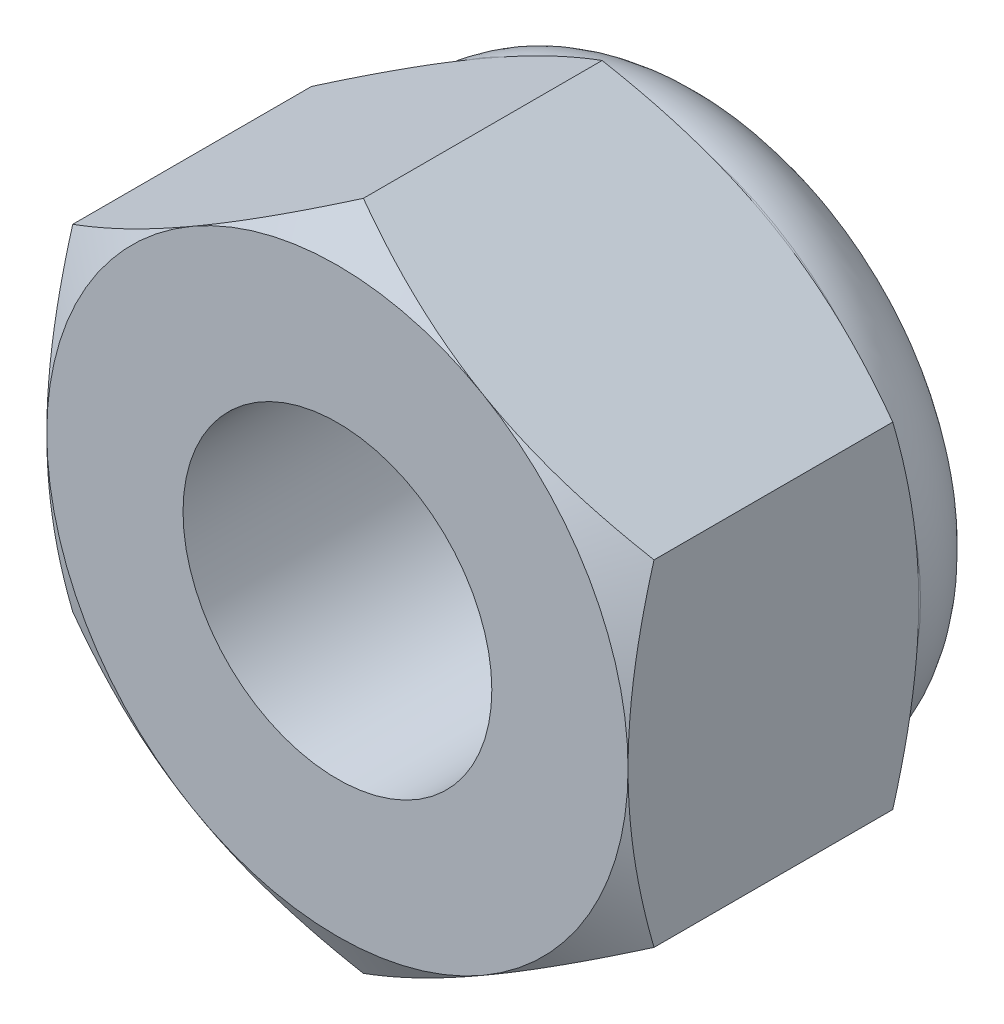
ISO-10303-21;
HEADER;
FILE_DESCRIPTION(('STEP AP214'),'2;1');
FILE_NAME('part.step','',(''),(''),'','','');
FILE_SCHEMA(('AUTOMOTIVE_DESIGN { 1 0 10303 214 1 1 1 1 }'));
ENDSEC;
DATA;
#1=APPLICATION_CONTEXT('core data for automotive mechanical design processes');
#2=APPLICATION_PROTOCOL_DEFINITION('international standard','automotive_design',2000,#1);
#3=PRODUCT_CONTEXT('',#1,'mechanical');
#4=PRODUCT('Part','Part','',(#3));
#5=PRODUCT_RELATED_PRODUCT_CATEGORY('part','',(#4));
#6=PRODUCT_DEFINITION_FORMATION('','',#4);
#7=PRODUCT_DEFINITION_CONTEXT('part definition',#1,'design');
#8=PRODUCT_DEFINITION('design','',#6,#7);
#9=PRODUCT_DEFINITION_SHAPE('','',#8);
#10=(LENGTH_UNIT() NAMED_UNIT(*) SI_UNIT(.MILLI.,.METRE.));
#11=(NAMED_UNIT(*) PLANE_ANGLE_UNIT() SI_UNIT($,.RADIAN.));
#12=(NAMED_UNIT(*) SI_UNIT($,.STERADIAN.) SOLID_ANGLE_UNIT());
#13=UNCERTAINTY_MEASURE_WITH_UNIT(LENGTH_MEASURE(1.E-05),#10,'distance_accuracy_value','');
#14=(GEOMETRIC_REPRESENTATION_CONTEXT(3) GLOBAL_UNCERTAINTY_ASSIGNED_CONTEXT((#13)) GLOBAL_UNIT_ASSIGNED_CONTEXT((#10,
#11,#12)) REPRESENTATION_CONTEXT('',''));
#15=CARTESIAN_POINT('',(0.,0.,0.));
#16=DIRECTION('',(0.,0.,1.));
#17=DIRECTION('',(1.,0.,0.));
#18=AXIS2_PLACEMENT_3D('',#15,#16,#17);
#19=CARTESIAN_POINT('',(-7.99999999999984,13.856406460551,0.));
#20=DIRECTION('',(0.,0.,-0.999999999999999));
#21=DIRECTION('',(-0.999999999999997,0.,0.));
#22=AXIS2_PLACEMENT_3D('',#19,#20,#21);
#23=PLANE('',#22);
#24=CARTESIAN_POINT('',(0.,0.,0.));
#25=DIRECTION('',(0.,0.,0.999999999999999));
#26=DIRECTION('',(0.999999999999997,0.,0.));
#27=AXIS2_PLACEMENT_3D('',#24,#25,#26);
#28=CIRCLE('',#27,4.24999999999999);
#29=CARTESIAN_POINT('',(4.24999999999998,0.,0.));
#30=VERTEX_POINT('',#29);
#31=EDGE_CURVE('E341',#30,#30,#28,.T.);
#32=ORIENTED_EDGE('',*,*,#31,.F.);
#33=EDGE_LOOP('',(#32));
#34=FACE_BOUND('',#33,.T.);
#35=CARTESIAN_POINT('',(0.,0.,0.));
#36=DIRECTION('',(0.,0.,-0.999999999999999));
#37=DIRECTION('',(-0.999999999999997,0.,0.));
#38=AXIS2_PLACEMENT_3D('',#35,#36,#37);
#39=CIRCLE('',#38,8.);
#40=CARTESIAN_POINT('',(-7.9999999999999,0.,0.));
#41=VERTEX_POINT('',#40);
#42=CARTESIAN_POINT('',(-4.,6.92820323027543,0.));
#43=VERTEX_POINT('',#42);
#44=EDGE_CURVE('E156',#41,#43,#39,.T.);
#45=ORIENTED_EDGE('',*,*,#44,.F.);
#46=CARTESIAN_POINT('',(0.,0.,0.));
#47=DIRECTION('',(0.,0.,-0.999999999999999));
#48=DIRECTION('',(-0.999999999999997,0.,0.));
#49=AXIS2_PLACEMENT_3D('',#46,#47,#48);
#50=CIRCLE('',#49,8.);
#51=CARTESIAN_POINT('',(-3.99999999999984,-6.92820323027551,0.));
#52=VERTEX_POINT('',#51);
#53=EDGE_CURVE('E145',#41,#52,#50,.F.);
#54=ORIENTED_EDGE('',*,*,#53,.T.);
#55=CARTESIAN_POINT('',(4.00000000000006,-6.92820323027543,-1.11022302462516E-13));
#56=VERTEX_POINT('',#55);
#57=EDGE_CURVE('E261',#52,#56,#50,.F.);
#58=ORIENTED_EDGE('',*,*,#57,.T.);
#59=CARTESIAN_POINT('',(8.00000000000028,0.,-2.22044604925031E-13));
#60=VERTEX_POINT('',#59);
#61=EDGE_CURVE('E266',#56,#60,#50,.F.);
#62=ORIENTED_EDGE('',*,*,#61,.T.);
#63=CARTESIAN_POINT('',(4.00000000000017,6.9282032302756,-3.33066907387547E-13));
#64=VERTEX_POINT('',#63);
#65=EDGE_CURVE('E267',#60,#64,#50,.F.);
#66=ORIENTED_EDGE('',*,*,#65,.T.);
#67=EDGE_CURVE('E248',#64,#43,#50,.F.);
#68=ORIENTED_EDGE('',*,*,#67,.T.);
#69=EDGE_LOOP('',(#45,#54,#58,#62,#66,#68));
#70=FACE_BOUND('',#69,.T.);
#71=ADVANCED_FACE('F32',(#34,#70),#23,.F.);
#72=CARTESIAN_POINT('',(0.,0.,0.));
#73=DIRECTION('',(0.,0.,-0.999999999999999));
#74=DIRECTION('',(-0.999999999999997,0.,0.));
#75=AXIS2_PLACEMENT_3D('',#72,#73,#74);
#76=CONICAL_SURFACE('',#75,8.,1.0471975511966);
#77=CARTESIAN_POINT('',(-8.00000000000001,-12.4289414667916,-3.91502438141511));
#78=CARTESIAN_POINT('',(-7.99999999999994,-12.0792916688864,-3.74532345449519));
#79=CARTESIAN_POINT('',(-7.99999999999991,-11.7288415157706,-3.57724345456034));
#80=CARTESIAN_POINT('',(-7.99999999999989,-11.025914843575,-3.24523667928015));
#81=CARTESIAN_POINT('',(-7.99999999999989,-10.6734380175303,-3.08131055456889));
#82=CARTESIAN_POINT('',(-7.9999999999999,-9.96422754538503,-2.75770323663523));
#83=CARTESIAN_POINT('',(-7.9999999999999,-9.6074811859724,-2.59804980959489));
#84=CARTESIAN_POINT('',(-7.9999999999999,-8.89115828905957,-2.28524838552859));
#85=CARTESIAN_POINT('',(-7.9999999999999,-8.53158188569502,-2.13210008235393));
#86=CARTESIAN_POINT('',(-7.9999999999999,-7.79743820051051,-1.8292454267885));
#87=CARTESIAN_POINT('',(-7.99999999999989,-7.42275986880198,-1.67980678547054));
#88=CARTESIAN_POINT('',(-7.9999999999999,-6.66902920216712,-1.3921856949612));
#89=CARTESIAN_POINT('',(-7.9999999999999,-6.28997638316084,-1.25400450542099));
#90=CARTESIAN_POINT('',(-7.99999999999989,-5.52759087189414,-0.992509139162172));
#91=CARTESIAN_POINT('',(-7.99999999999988,-5.14426853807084,-0.86916508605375));
#92=CARTESIAN_POINT('',(-7.99999999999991,-4.37213964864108,-0.641285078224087));
#93=CARTESIAN_POINT('',(-7.99999999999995,-3.98333485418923,-0.536743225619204));
#94=CARTESIAN_POINT('',(-7.99999999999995,-3.20206398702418,-0.35201985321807));
#95=CARTESIAN_POINT('',(-7.99999999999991,-2.80962942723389,-0.271708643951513));
#96=CARTESIAN_POINT('',(-7.99999999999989,-2.21738673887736,-0.172892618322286));
#97=CARTESIAN_POINT('',(-7.99999999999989,-2.01935997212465,-0.143561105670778));
#98=CARTESIAN_POINT('',(-7.9999999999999,-1.62231457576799,-0.0926897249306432));
#99=CARTESIAN_POINT('',(-7.9999999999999,-1.42329604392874,-0.0711491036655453));
#100=CARTESIAN_POINT('',(-7.9999999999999,-1.02714522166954,-0.0365601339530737));
#101=CARTESIAN_POINT('',(-7.9999999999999,-0.830022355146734,-0.0234042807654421));
#102=CARTESIAN_POINT('',(-7.99999999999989,-0.435396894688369,-0.00544139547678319));
#103=CARTESIAN_POINT('',(-7.99999999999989,-0.237894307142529,-0.000634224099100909));
#104=CARTESIAN_POINT('',(-7.9999999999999,0.157138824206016,0.000516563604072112));
#105=CARTESIAN_POINT('',(-7.99999999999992,0.354669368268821,-0.0031399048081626));
#106=CARTESIAN_POINT('',(-7.99999999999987,0.749400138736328,-0.0188268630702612));
#107=CARTESIAN_POINT('',(-7.9999999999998,0.946600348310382,-0.0308577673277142));
#108=CARTESIAN_POINT('',(-7.99999999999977,1.41976781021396,-0.0695170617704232));
#109=CARTESIAN_POINT('',(-7.99999999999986,1.69542073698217,-0.100076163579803));
#110=CARTESIAN_POINT('',(-7.99999999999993,2.24468314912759,-0.175896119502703));
#111=CARTESIAN_POINT('',(-7.99999999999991,2.51829235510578,-0.221158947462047));
#112=CARTESIAN_POINT('',(-7.99999999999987,3.33573277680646,-0.376603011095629));
#113=CARTESIAN_POINT('',(-7.99999999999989,3.87588099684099,-0.506412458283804));
#114=CARTESIAN_POINT('',(-7.9999999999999,4.68375598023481,-0.731593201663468));
#115=CARTESIAN_POINT('',(-7.9999999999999,4.95566805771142,-0.812812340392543));
#116=CARTESIAN_POINT('',(-7.99999999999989,5.49685040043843,-0.983699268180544));
#117=CARTESIAN_POINT('',(-7.99999999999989,5.76612064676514,-1.07336711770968));
#118=CARTESIAN_POINT('',(-7.9999999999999,6.30210618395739,-1.2597113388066));
#119=CARTESIAN_POINT('',(-7.99999999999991,6.56882226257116,-1.35638546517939));
#120=CARTESIAN_POINT('',(-7.99999999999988,7.10004114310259,-1.5556031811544));
#121=CARTESIAN_POINT('',(-7.99999999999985,7.36454398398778,-1.65814666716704));
#122=CARTESIAN_POINT('',(-7.99999999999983,8.03954864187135,-1.92707319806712));
#123=CARTESIAN_POINT('',(-7.99999999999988,8.44864651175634,-2.09697564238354));
#124=CARTESIAN_POINT('',(-7.99999999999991,9.26296702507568,-2.44585611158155));
#125=CARTESIAN_POINT('',(-7.9999999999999,9.66818933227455,-2.62483491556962));
#126=CARTESIAN_POINT('',(-7.99999999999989,10.475581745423,-2.98985031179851));
#127=CARTESIAN_POINT('',(-7.99999999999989,10.8777508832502,-3.17588903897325));
#128=CARTESIAN_POINT('',(-7.99999999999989,11.6794880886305,-3.55344155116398));
#129=CARTESIAN_POINT('',(-7.99999999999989,12.0790562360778,-3.74495516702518));
#130=CARTESIAN_POINT('',(-7.99999999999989,12.876615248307,-4.13259501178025));
#131=CARTESIAN_POINT('',(-7.99999999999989,13.2746032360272,-4.32872714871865));
#132=CARTESIAN_POINT('',(-7.99999999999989,14.0688317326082,-4.72449899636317));
#133=CARTESIAN_POINT('',(-7.99999999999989,14.4650722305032,-4.92413872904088));
#134=CARTESIAN_POINT('',(-7.99999999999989,15.2560315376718,-5.32623624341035));
#135=CARTESIAN_POINT('',(-7.99999999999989,15.6507506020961,-5.52869352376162));
#136=CARTESIAN_POINT('',(-7.99999999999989,16.438974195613,-5.93595999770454));
#137=CARTESIAN_POINT('',(-7.99999999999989,16.8324787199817,-6.14076920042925));
#138=CARTESIAN_POINT('',(-7.99999999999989,17.9357396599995,-6.7184651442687));
#139=CARTESIAN_POINT('',(-7.99999999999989,18.6443410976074,-7.09355729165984));
#140=CARTESIAN_POINT('',(-7.99999999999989,20.0590897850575,-7.84841354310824));
#141=CARTESIAN_POINT('',(-7.99999999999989,20.7652369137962,-8.22817787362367));
#142=CARTESIAN_POINT('',(-7.99999999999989,22.1735698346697,-8.99010012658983));
#143=CARTESIAN_POINT('',(-7.9999999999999,22.8757611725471,-9.37224780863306));
#144=CARTESIAN_POINT('',(-7.99999999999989,24.2786001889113,-10.1392568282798));
#145=CARTESIAN_POINT('',(-7.99999999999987,24.9792479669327,-10.5241179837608));
#146=CARTESIAN_POINT('',(-7.99999999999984,25.6793433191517,-10.9099740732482));
#147=B_SPLINE_CURVE_WITH_KNOTS('',3,(#77,#78,#79,#80,#81,#82,#83,#84,#85,#86,#87,#88,#89,#90,
#91,#92,#93,#94,#95,#96,#97,#98,#99,#100,#101,#102,#103,#104,#105,#106,#107,#108,#109,#110,#111,
#112,#113,#114,#115,#116,#117,#118,#119,#120,#121,#122,#123,#124,#125,#126,#127,#128,#129,#130,
#131,#132,#133,#134,#135,#136,#137,#138,#139,#140,#141,#142,#143,#144,#145,#146),.UNSPECIFIED.,
.F.,.F.,(4,2,2,2,2,2,2,2,2,2,2,2,2,2,2,2,2,2,2,2,2,2,2,2,2,2,2,2,2,2,2,2,2,2,4),(0.,
1.16598174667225,2.33214500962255,3.5046178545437,4.6770354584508,5.8870363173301,
7.09717238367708,8.30482938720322,9.51210690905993,10.71280316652,11.3132358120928,
11.9136103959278,12.5061236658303,13.0986270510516,13.6911363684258,14.2836750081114,
15.1152308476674,15.9468983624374,17.6111205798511,18.4623977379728,19.3136809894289,
20.1646926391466,21.0156892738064,22.3444603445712,23.6733456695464,25.0026361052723,
26.3318855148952,27.6629391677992,28.9940011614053,30.324829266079,31.6556625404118,
34.0608989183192,36.4662523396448,38.8645752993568,41.2627387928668),.UNSPECIFIED.);
#148=CARTESIAN_POINT('',(-8.00000000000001,4.61880215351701,-0.714531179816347));
#149=VERTEX_POINT('',#148);
#150=EDGE_CURVE('E173',#149,#41,#147,.F.);
#151=ORIENTED_EDGE('',*,*,#150,.T.);
#152=ORIENTED_EDGE('',*,*,#44,.T.);
#153=CARTESIAN_POINT('',(0.00019999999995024,9.23771977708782,-0.714597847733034));
#154=CARTESIAN_POINT('',(-0.175648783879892,9.13619343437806,-0.655990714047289));
#155=CARTESIAN_POINT('',(-0.352153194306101,9.03428856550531,-0.600043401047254));
#156=CARTESIAN_POINT('',(-0.70659546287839,8.82965122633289,-0.494201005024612));
#157=CARTESIAN_POINT('',(-0.884533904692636,8.72691841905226,-0.444308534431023));
#158=CARTESIAN_POINT('',(-1.42119823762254,8.41707512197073,-0.304692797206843));
#159=CARTESIAN_POINT('',(-1.78204258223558,8.20874154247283,-0.225281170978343));
#160=CARTESIAN_POINT('',(-2.32203917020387,7.89697436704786,-0.132161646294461));
#161=CARTESIAN_POINT('',(-2.49957818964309,7.79447216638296,-0.105634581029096));
#162=CARTESIAN_POINT('',(-2.85545911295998,7.5890042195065,-0.0611531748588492));
#163=CARTESIAN_POINT('',(-3.03380094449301,7.48603851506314,-0.0431980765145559));
#164=CARTESIAN_POINT('',(-3.39079168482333,7.27992981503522,-0.0163156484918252));
#165=CARTESIAN_POINT('',(-3.56944001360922,7.17678715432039,-0.00737807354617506));
#166=CARTESIAN_POINT('',(-3.9269017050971,6.97040655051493,0.00127769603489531));
#167=CARTESIAN_POINT('',(-4.1057150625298,6.86716861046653,0.000996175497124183));
#168=CARTESIAN_POINT('',(-4.44001336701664,6.67416139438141,-0.00814502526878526));
#169=CARTESIAN_POINT('',(-4.59552190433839,6.58437849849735,-0.0158896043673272));
#170=CARTESIAN_POINT('',(-4.90617476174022,6.40502298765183,-0.0382011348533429));
#171=CARTESIAN_POINT('',(-5.06131905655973,6.31545038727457,-0.0527685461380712));
#172=CARTESIAN_POINT('',(-5.52615131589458,6.0470793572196,-0.106360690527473));
#173=CARTESIAN_POINT('',(-5.83501648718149,5.86875596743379,-0.155268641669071));
#174=CARTESIAN_POINT('',(-6.4560232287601,5.5102175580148,-0.277539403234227));
#175=CARTESIAN_POINT('',(-6.76808554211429,5.33004829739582,-0.35142052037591));
#176=CARTESIAN_POINT('',(-7.38755648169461,4.97239658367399,-0.519100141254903));
#177=CARTESIAN_POINT('',(-7.69497304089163,4.79490955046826,-0.612859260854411));
#178=CARTESIAN_POINT('',(-8.0001999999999,4.61868668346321,-0.714597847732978));
#179=B_SPLINE_CURVE_WITH_KNOTS('',3,(#153,#154,#155,#156,#157,#158,#159,#160,#161,#162,#163,
#164,#165,#166,#167,#168,#169,#170,#171,#172,#173,#174,#175,#176,#177,#178),.UNSPECIFIED.,.F.,
.F.,(4,2,2,2,2,2,2,2,2,2,2,2,4),(0.,0.633973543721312,1.26821965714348,2.53934712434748,
3.15934343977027,3.77928496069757,4.39852133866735,5.0177385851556,5.55680239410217,
6.09590254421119,7.17487077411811,8.27776850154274,9.37850115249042),.UNSPECIFIED.);
#180=EDGE_CURVE('E160',#43,#149,#179,.T.);
#181=ORIENTED_EDGE('',*,*,#180,.T.);
#182=EDGE_LOOP('',(#151,#152,#181));
#183=FACE_BOUND('',#182,.T.);
#184=ADVANCED_FACE('F180',(#183),#76,.T.);
#185=CARTESIAN_POINT('',(8.00020000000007,4.61868668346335,-0.7145978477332));
#186=CARTESIAN_POINT('',(7.82435121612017,4.720213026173,-0.655990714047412));
#187=CARTESIAN_POINT('',(7.64784680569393,4.82211789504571,-0.600043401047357));
#188=CARTESIAN_POINT('',(7.29340453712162,5.02675523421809,-0.494201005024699));
#189=CARTESIAN_POINT('',(7.11546609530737,5.12948804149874,-0.444308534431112));
#190=CARTESIAN_POINT('',(6.57880176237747,5.4393313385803,-0.304692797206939));
#191=CARTESIAN_POINT('',(6.21795741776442,5.64766491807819,-0.225281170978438));
#192=CARTESIAN_POINT('',(5.67796082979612,5.95943209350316,-0.13216164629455));
#193=CARTESIAN_POINT('',(5.5004218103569,6.06193429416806,-0.105634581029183));
#194=CARTESIAN_POINT('',(5.14454088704,6.26740224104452,-0.0611531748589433));
#195=CARTESIAN_POINT('',(4.96619905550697,6.37036794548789,-0.0431980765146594));
#196=CARTESIAN_POINT('',(4.60920831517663,6.57647664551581,-0.0163156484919));
#197=CARTESIAN_POINT('',(4.43055998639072,6.67961930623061,-0.00737807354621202));
#198=CARTESIAN_POINT('',(4.07309829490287,6.88599991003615,0.00127769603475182));
#199=CARTESIAN_POINT('',(3.89428493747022,6.98923785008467,0.000996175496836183));
#200=CARTESIAN_POINT('',(3.55998663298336,7.18224506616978,-0.00814502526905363));
#201=CARTESIAN_POINT('',(3.40447809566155,7.27202796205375,-0.0158896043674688));
#202=CARTESIAN_POINT('',(3.09382523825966,7.4513834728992,-0.0382011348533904));
#203=CARTESIAN_POINT('',(2.93868094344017,7.54095607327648,-0.0527685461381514));
#204=CARTESIAN_POINT('',(2.47384868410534,7.8093271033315,-0.106360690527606));
#205=CARTESIAN_POINT('',(2.16498351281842,7.98765049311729,-0.15526864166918));
#206=CARTESIAN_POINT('',(1.54397677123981,8.34618890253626,-0.277539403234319));
#207=CARTESIAN_POINT('',(1.23191445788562,8.52635816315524,-0.351420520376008));
#208=CARTESIAN_POINT('',(0.612443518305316,8.88400987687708,-0.519100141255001));
#209=CARTESIAN_POINT('',(0.30502695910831,9.06149691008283,-0.612859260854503));
#210=CARTESIAN_POINT('',(-0.00019999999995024,9.23771977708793,-0.714597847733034));
#211=B_SPLINE_CURVE_WITH_KNOTS('',3,(#185,#186,#187,#188,#189,#190,#191,#192,#193,#194,#195,
#196,#197,#198,#199,#200,#201,#202,#203,#204,#205,#206,#207,#208,#209,#210),.UNSPECIFIED.,.F.,
.F.,(4,2,2,2,2,2,2,2,2,2,2,2,4),(0.,0.633973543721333,1.26821965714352,2.53934712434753,
3.15934343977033,3.77928496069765,4.39852133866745,5.01773858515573,5.55680239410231,
6.09590254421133,7.17487077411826,8.27776850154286,9.37850115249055),.UNSPECIFIED.);
#212=CARTESIAN_POINT('',(1.11022302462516E-13,9.23760430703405,-0.714531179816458));
#213=VERTEX_POINT('',#212);
#214=EDGE_CURVE('E198',#64,#213,#211,.T.);
#215=ORIENTED_EDGE('',*,*,#214,.T.);
#216=EDGE_CURVE('E172',#213,#43,#179,.T.);
#217=ORIENTED_EDGE('',*,*,#216,.T.);
#218=ORIENTED_EDGE('',*,*,#67,.F.);
#219=EDGE_LOOP('',(#215,#217,#218));
#220=FACE_BOUND('',#219,.T.);
#221=ADVANCED_FACE('F185',(#220),#76,.T.);
#222=CARTESIAN_POINT('',(8.00000000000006,-12.4289414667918,-3.91502438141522));
#223=CARTESIAN_POINT('',(8.00000000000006,-12.0792916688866,-3.74532345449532));
#224=CARTESIAN_POINT('',(8.00000000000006,-11.7288415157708,-3.57724345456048));
#225=CARTESIAN_POINT('',(8.00000000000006,-11.0259148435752,-3.2452366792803));
#226=CARTESIAN_POINT('',(8.00000000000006,-10.6734380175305,-3.08131055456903));
#227=CARTESIAN_POINT('',(8.00000000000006,-9.96422754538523,-2.75770323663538));
#228=CARTESIAN_POINT('',(8.00000000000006,-9.6074811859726,-2.59804980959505));
#229=CARTESIAN_POINT('',(8.00000000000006,-8.89115828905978,-2.28524838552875));
#230=CARTESIAN_POINT('',(8.00000000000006,-8.53158188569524,-2.13210008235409));
#231=CARTESIAN_POINT('',(8.00000000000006,-7.79743820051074,-1.82924542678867));
#232=CARTESIAN_POINT('',(8.00000000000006,-7.42275986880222,-1.67980678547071));
#233=CARTESIAN_POINT('',(8.00000000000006,-6.66902920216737,-1.39218569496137));
#234=CARTESIAN_POINT('',(8.00000000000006,-6.2899763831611,-1.25400450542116));
#235=CARTESIAN_POINT('',(8.00000000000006,-5.52759087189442,-0.99250913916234));
#236=CARTESIAN_POINT('',(8.00000000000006,-5.14426853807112,-0.869165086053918));
#237=CARTESIAN_POINT('',(8.00000000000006,-4.37213964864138,-0.641285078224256));
#238=CARTESIAN_POINT('',(8.00000000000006,-3.98333485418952,-0.536743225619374));
#239=CARTESIAN_POINT('',(8.00000000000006,-3.20206398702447,-0.352019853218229));
#240=CARTESIAN_POINT('',(8.00000000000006,-2.80962942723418,-0.27170864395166));
#241=CARTESIAN_POINT('',(8.00000000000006,-2.21738673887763,-0.17289261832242));
#242=CARTESIAN_POINT('',(8.00000000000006,-2.01935997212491,-0.143561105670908));
#243=CARTESIAN_POINT('',(8.00000000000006,-1.62231457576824,-0.0926897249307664));
#244=CARTESIAN_POINT('',(8.00000000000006,-1.42329604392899,-0.0711491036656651));
#245=CARTESIAN_POINT('',(8.00000000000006,-1.02714522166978,-0.0365601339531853));
#246=CARTESIAN_POINT('',(8.00000000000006,-0.830022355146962,-0.0234042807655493));
#247=CARTESIAN_POINT('',(8.00000000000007,-0.435396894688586,-0.00544139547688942));
#248=CARTESIAN_POINT('',(8.00000000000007,-0.237894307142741,-0.000634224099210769));
#249=CARTESIAN_POINT('',(8.00000000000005,0.157138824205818,0.000516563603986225));
#250=CARTESIAN_POINT('',(8.00000000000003,0.354669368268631,-0.00313990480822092));
#251=CARTESIAN_POINT('',(8.0000000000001,0.74940013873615,-0.0188268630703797));
#252=CARTESIAN_POINT('',(8.00000000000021,0.946600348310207,-0.0308577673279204));
#253=CARTESIAN_POINT('',(8.00000000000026,1.4197678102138,-0.0695170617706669));
#254=CARTESIAN_POINT('',(8.00000000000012,1.69542073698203,-0.100076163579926));
#255=CARTESIAN_POINT('',(8.00000000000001,2.24468314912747,-0.175896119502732));
#256=CARTESIAN_POINT('',(8.00000000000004,2.51829235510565,-0.221158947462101));
#257=CARTESIAN_POINT('',(8.0000000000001,3.33573277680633,-0.376603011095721));
#258=CARTESIAN_POINT('',(8.00000000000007,3.87588099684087,-0.506412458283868));
#259=CARTESIAN_POINT('',(8.00000000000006,4.68375598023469,-0.731593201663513));
#260=CARTESIAN_POINT('',(8.00000000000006,4.95566805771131,-0.812812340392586));
#261=CARTESIAN_POINT('',(8.00000000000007,5.49685040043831,-0.983699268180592));
#262=CARTESIAN_POINT('',(8.00000000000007,5.76612064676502,-1.07336711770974));
#263=CARTESIAN_POINT('',(8.00000000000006,6.30210618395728,-1.25971133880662));
#264=CARTESIAN_POINT('',(8.00000000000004,6.56882226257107,-1.35638546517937));
#265=CARTESIAN_POINT('',(8.00000000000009,7.10004114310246,-1.55560318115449));
#266=CARTESIAN_POINT('',(8.00000000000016,7.3645439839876,-1.65814666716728));
#267=CARTESIAN_POINT('',(8.0000000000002,8.03954864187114,-1.92707319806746));
#268=CARTESIAN_POINT('',(8.0000000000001,8.44864651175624,-2.09697564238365));
#269=CARTESIAN_POINT('',(8.00000000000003,9.26296702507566,-2.44585611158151));
#270=CARTESIAN_POINT('',(8.00000000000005,9.66818933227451,-2.62483491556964));
#271=CARTESIAN_POINT('',(8.00000000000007,10.475581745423,-2.98985031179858));
#272=CARTESIAN_POINT('',(8.00000000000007,10.8777508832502,-3.1758890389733));
#273=CARTESIAN_POINT('',(8.00000000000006,11.6794880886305,-3.55344155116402));
#274=CARTESIAN_POINT('',(8.00000000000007,12.0790562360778,-3.74495516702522));
#275=CARTESIAN_POINT('',(8.00000000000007,12.876615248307,-4.13259501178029));
#276=CARTESIAN_POINT('',(8.00000000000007,13.2746032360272,-4.32872714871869));
#277=CARTESIAN_POINT('',(8.00000000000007,14.0688317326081,-4.72449899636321));
#278=CARTESIAN_POINT('',(8.00000000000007,14.4650722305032,-4.92413872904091));
#279=CARTESIAN_POINT('',(8.00000000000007,15.2560315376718,-5.32623624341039));
#280=CARTESIAN_POINT('',(8.00000000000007,15.6507506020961,-5.52869352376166));
#281=CARTESIAN_POINT('',(8.00000000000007,16.438974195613,-5.93595999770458));
#282=CARTESIAN_POINT('',(8.00000000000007,16.8324787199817,-6.14076920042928));
#283=CARTESIAN_POINT('',(8.00000000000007,17.9357396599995,-6.71846514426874));
#284=CARTESIAN_POINT('',(8.00000000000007,18.6443410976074,-7.09355729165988));
#285=CARTESIAN_POINT('',(8.00000000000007,20.0590897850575,-7.84841354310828));
#286=CARTESIAN_POINT('',(8.00000000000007,20.7652369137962,-8.22817787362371));
#287=CARTESIAN_POINT('',(8.00000000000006,22.1735698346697,-8.99010012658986));
#288=CARTESIAN_POINT('',(8.00000000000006,22.8757611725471,-9.37224780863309));
#289=CARTESIAN_POINT('',(8.00000000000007,24.2786001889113,-10.1392568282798));
#290=CARTESIAN_POINT('',(8.00000000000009,24.9792479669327,-10.5241179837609));
#291=CARTESIAN_POINT('',(8.00000000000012,25.6793433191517,-10.9099740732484));
#292=B_SPLINE_CURVE_WITH_KNOTS('',3,(#222,#223,#224,#225,#226,#227,#228,#229,#230,#231,#232,
#233,#234,#235,#236,#237,#238,#239,#240,#241,#242,#243,#244,#245,#246,#247,#248,#249,#250,#251,
#252,#253,#254,#255,#256,#257,#258,#259,#260,#261,#262,#263,#264,#265,#266,#267,#268,#269,#270,
#271,#272,#273,#274,#275,#276,#277,#278,#279,#280,#281,#282,#283,#284,#285,#286,#287,#288,#289,
#290,#291),.UNSPECIFIED.,.F.,.F.,(4,2,2,2,2,2,2,2,2,2,2,2,2,2,2,2,2,2,2,2,2,2,2,2,2,2,2,2,2,2,2,
2,2,2,4),(0.,1.16598174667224,2.33214500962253,3.50461785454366,4.67703545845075,
5.88703631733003,7.09717238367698,8.30482938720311,9.5121069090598,10.7128031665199,
11.3132358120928,11.9136103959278,12.5061236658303,13.0986270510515,13.6911363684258,
14.2836750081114,15.1152308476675,15.9468983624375,17.6111205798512,18.4623977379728,
19.313680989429,20.1646926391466,21.0156892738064,22.3444603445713,23.6733456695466,
25.0026361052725,26.3318855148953,27.6629391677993,28.9940011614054,30.3248292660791,
31.6556625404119,34.0608989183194,36.4662523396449,38.8645752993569,41.262738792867),.UNSPECIFIED.);
#293=CARTESIAN_POINT('',(8.00000000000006,4.61880215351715,-0.714531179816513));
#294=VERTEX_POINT('',#293);
#295=EDGE_CURVE('E209',#60,#294,#292,.T.);
#296=ORIENTED_EDGE('',*,*,#295,.T.);
#297=EDGE_CURVE('E285',#294,#64,#211,.T.);
#298=ORIENTED_EDGE('',*,*,#297,.T.);
#299=ORIENTED_EDGE('',*,*,#65,.F.);
#300=EDGE_LOOP('',(#296,#298,#299));
#301=FACE_BOUND('',#300,.T.);
#302=ADVANCED_FACE('F284',(#301),#76,.T.);
#303=CARTESIAN_POINT('',(-0.000200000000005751,-9.23771977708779,-0.714597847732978));
#304=CARTESIAN_POINT('',(0.175648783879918,-9.1361934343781,-0.6559907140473));
#305=CARTESIAN_POINT('',(0.35215319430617,-9.03428856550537,-0.60004340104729));
#306=CARTESIAN_POINT('',(0.706595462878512,-8.82965122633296,-0.494201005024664));
#307=CARTESIAN_POINT('',(0.884533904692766,-8.72691841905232,-0.444308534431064));
#308=CARTESIAN_POINT('',(1.4211982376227,-8.41707512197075,-0.304692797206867));
#309=CARTESIAN_POINT('',(1.78204258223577,-8.20874154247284,-0.225281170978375));
#310=CARTESIAN_POINT('',(2.3220391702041,-7.89697436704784,-0.132161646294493));
#311=CARTESIAN_POINT('',(2.49957818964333,-7.79447216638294,-0.105634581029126));
#312=CARTESIAN_POINT('',(2.85545911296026,-7.58900421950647,-0.0611531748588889));
#313=CARTESIAN_POINT('',(3.0338009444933,-7.4860385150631,-0.0431980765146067));
#314=CARTESIAN_POINT('',(3.39079168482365,-7.27992981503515,-0.0163156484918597));
#315=CARTESIAN_POINT('',(3.56944001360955,-7.1767871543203,-0.00737807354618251));
#316=CARTESIAN_POINT('',(3.92690170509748,-6.97040655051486,0.00127769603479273));
#317=CARTESIAN_POINT('',(4.10571506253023,-6.86716861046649,0.000996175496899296));
#318=CARTESIAN_POINT('',(4.44001336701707,-6.67416139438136,-0.00814502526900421));
#319=CARTESIAN_POINT('',(4.5955219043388,-6.58437849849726,-0.0158896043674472));
#320=CARTESIAN_POINT('',(4.9061747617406,-6.40502298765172,-0.0382011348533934));
#321=CARTESIAN_POINT('',(5.0613190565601,-6.31545038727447,-0.0527685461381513));
#322=CARTESIAN_POINT('',(5.52615131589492,-6.04707935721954,-0.106360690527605));
#323=CARTESIAN_POINT('',(5.83501648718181,-5.86875596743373,-0.155268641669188));
#324=CARTESIAN_POINT('',(6.45602322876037,-5.51021755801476,-0.277539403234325));
#325=CARTESIAN_POINT('',(6.76808554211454,-5.3300482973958,-0.351420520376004));
#326=CARTESIAN_POINT('',(7.3875564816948,-4.972396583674,-0.519100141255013));
#327=CARTESIAN_POINT('',(7.69497304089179,-4.79490955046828,-0.612859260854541));
#328=CARTESIAN_POINT('',(8.00020000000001,-4.61868668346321,-0.714597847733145));
#329=B_SPLINE_CURVE_WITH_KNOTS('',3,(#303,#304,#305,#306,#307,#308,#309,#310,#311,#312,#313,
#314,#315,#316,#317,#318,#319,#320,#321,#322,#323,#324,#325,#326,#327,#328),.UNSPECIFIED.,.F.,
.F.,(4,2,2,2,2,2,2,2,2,2,2,2,4),(0.,0.633973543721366,1.26821965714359,2.53934712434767,
3.15934343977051,3.77928496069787,4.3985213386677,5.01773858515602,5.55680239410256,
6.09590254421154,7.17487077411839,8.27776850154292,9.37850115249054),.UNSPECIFIED.);
#330=CARTESIAN_POINT('',(8.00000000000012,-4.61880215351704,-0.714531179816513));
#331=VERTEX_POINT('',#330);
#332=EDGE_CURVE('E215',#56,#331,#329,.T.);
#333=ORIENTED_EDGE('',*,*,#332,.T.);
#334=EDGE_CURVE('E214',#331,#60,#292,.T.);
#335=ORIENTED_EDGE('',*,*,#334,.T.);
#336=ORIENTED_EDGE('',*,*,#61,.F.);
#337=EDGE_LOOP('',(#333,#335,#336));
#338=FACE_BOUND('',#337,.T.);
#339=ADVANCED_FACE('F308',(#338),#76,.T.);
#340=CARTESIAN_POINT('',(0.,-9.23760430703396,-0.714531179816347));
#341=VERTEX_POINT('',#340);
#342=EDGE_CURVE('E135',#341,#56,#329,.T.);
#343=ORIENTED_EDGE('',*,*,#342,.T.);
#344=ORIENTED_EDGE('',*,*,#57,.F.);
#345=CARTESIAN_POINT('',(-8.0001999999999,-4.61868668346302,-0.714597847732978));
#346=CARTESIAN_POINT('',(-7.82435121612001,-4.72021302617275,-0.655990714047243));
#347=CARTESIAN_POINT('',(-7.64784680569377,-4.8221178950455,-0.600043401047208));
#348=CARTESIAN_POINT('',(-7.29340453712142,-5.02675523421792,-0.494201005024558));
#349=CARTESIAN_POINT('',(-7.11546609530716,-5.12948804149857,-0.44430853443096));
#350=CARTESIAN_POINT('',(-6.57880176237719,-5.43933133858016,-0.304692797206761));
#351=CARTESIAN_POINT('',(-6.2179574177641,-5.64766491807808,-0.225281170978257));
#352=CARTESIAN_POINT('',(-5.67796082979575,-5.95943209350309,-0.132161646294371));
#353=CARTESIAN_POINT('',(-5.5004218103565,-6.061934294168,-0.105634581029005));
#354=CARTESIAN_POINT('',(-5.14454088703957,-6.26740224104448,-0.0611531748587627));
#355=CARTESIAN_POINT('',(-4.96619905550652,-6.37036794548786,-0.0431980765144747));
#356=CARTESIAN_POINT('',(-4.60920831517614,-6.5764766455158,-0.0163156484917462));
#357=CARTESIAN_POINT('',(-4.43055998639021,-6.6796193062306,-0.00737807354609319));
#358=CARTESIAN_POINT('',(-4.07309829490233,-6.88599991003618,0.00127769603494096));
#359=CARTESIAN_POINT('',(-3.89428493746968,-6.98923785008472,0.000996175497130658));
#360=CARTESIAN_POINT('',(-3.55998663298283,-7.18224506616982,-0.00814502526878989));
#361=CARTESIAN_POINT('',(-3.40447809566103,-7.27202796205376,-0.01588960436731));
#362=CARTESIAN_POINT('',(-3.09382523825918,-7.45138347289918,-0.0382011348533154));
#363=CARTESIAN_POINT('',(-2.93868094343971,-7.54095607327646,-0.0527685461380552));
#364=CARTESIAN_POINT('',(-2.47384868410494,-7.80932710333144,-0.106360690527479));
#365=CARTESIAN_POINT('',(-2.16498351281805,-7.98765049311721,-0.155268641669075));
#366=CARTESIAN_POINT('',(-1.5439767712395,-8.34618890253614,-0.277539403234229));
#367=CARTESIAN_POINT('',(-1.23191445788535,-8.52635816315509,-0.351420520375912));
#368=CARTESIAN_POINT('',(-0.612443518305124,-8.88400987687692,-0.519100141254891));
#369=CARTESIAN_POINT('',(-0.305026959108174,-9.06149691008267,-0.612859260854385));
#370=CARTESIAN_POINT('',(0.000200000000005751,-9.23771977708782,-0.714597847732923));
#371=B_SPLINE_CURVE_WITH_KNOTS('',3,(#345,#346,#347,#348,#349,#350,#351,#352,#353,#354,#355,
#356,#357,#358,#359,#360,#361,#362,#363,#364,#365,#366,#367,#368,#369,#370),.UNSPECIFIED.,.F.,
.F.,(4,2,2,2,2,2,2,2,2,2,2,2,4),(0.,0.633973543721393,1.26821965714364,2.5393471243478,
3.15934343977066,3.77928496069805,4.3985213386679,5.01773858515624,5.55680239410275,
6.09590254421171,7.17487077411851,8.277768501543,9.37850115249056),.UNSPECIFIED.);
#372=EDGE_CURVE('E305',#52,#341,#371,.T.);
#373=ORIENTED_EDGE('',*,*,#372,.T.);
#374=EDGE_LOOP('',(#343,#344,#373));
#375=FACE_BOUND('',#374,.T.);
#376=ADVANCED_FACE('F187',(#375),#76,.T.);
#377=CARTESIAN_POINT('',(-7.9999999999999,-4.61880215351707,-0.714531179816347));
#378=VERTEX_POINT('',#377);
#379=EDGE_CURVE('E203',#378,#52,#371,.T.);
#380=ORIENTED_EDGE('',*,*,#379,.T.);
#381=ORIENTED_EDGE('',*,*,#53,.F.);
#382=EDGE_CURVE('E288',#41,#378,#147,.F.);
#383=ORIENTED_EDGE('',*,*,#382,.T.);
#384=EDGE_LOOP('',(#380,#381,#383));
#385=FACE_BOUND('',#384,.T.);
#386=ADVANCED_FACE('F301',(#385),#76,.T.);
#387=CARTESIAN_POINT('',(8.00000000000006,4.61880215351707,-8.00000000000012));
#388=DIRECTION('',(0.499999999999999,0.866025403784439,0.));
#389=DIRECTION('',(-0.866025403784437,0.5,0.));
#390=AXIS2_PLACEMENT_3D('',#387,#388,#389);
#391=PLANE('',#390);
#392=CARTESIAN_POINT('',(-0.000199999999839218,9.23771977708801,-7.28540215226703));
#393=CARTESIAN_POINT('',(0.175648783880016,9.1361934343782,-7.34400928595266));
#394=CARTESIAN_POINT('',(0.352153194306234,9.03428856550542,-7.39995659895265));
#395=CARTESIAN_POINT('',(0.706595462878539,8.82965122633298,-7.50579899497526));
#396=CARTESIAN_POINT('',(0.884533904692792,8.72691841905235,-7.55569146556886));
#397=CARTESIAN_POINT('',(1.42119823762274,8.4170751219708,-7.69530720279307));
#398=CARTESIAN_POINT('',(1.78204258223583,8.20874154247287,-7.77471882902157));
#399=CARTESIAN_POINT('',(2.32203917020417,7.89697436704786,-7.86783835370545));
#400=CARTESIAN_POINT('',(2.4995781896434,7.79447216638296,-7.89436541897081));
#401=CARTESIAN_POINT('',(2.85545911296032,7.58900421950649,-7.93884682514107));
#402=CARTESIAN_POINT('',(3.03380094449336,7.48603851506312,-7.95680192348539));
#403=CARTESIAN_POINT('',(3.3907916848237,7.27992981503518,-7.98368435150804));
#404=CARTESIAN_POINT('',(3.5694400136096,7.17678715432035,-7.9926219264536));
#405=CARTESIAN_POINT('',(3.92690170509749,6.97040655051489,-8.00127769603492));
#406=CARTESIAN_POINT('',(4.10571506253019,6.86716861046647,-8.00099617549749));
#407=CARTESIAN_POINT('',(4.440013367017,6.67416139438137,-7.99185497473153));
#408=CARTESIAN_POINT('',(4.59552190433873,6.58437849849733,-7.98411039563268));
#409=CARTESIAN_POINT('',(4.90617476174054,6.40502298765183,-7.96179886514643));
#410=CARTESIAN_POINT('',(5.06131905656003,6.31545038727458,-7.94723145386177));
#411=CARTESIAN_POINT('',(5.52615131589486,6.04707935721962,-7.8936393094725));
#412=CARTESIAN_POINT('',(5.83501648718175,5.86875596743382,-7.84473135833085));
#413=CARTESIAN_POINT('',(6.45602322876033,5.51021755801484,-7.72246059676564));
#414=CARTESIAN_POINT('',(6.76808554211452,5.33004829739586,-7.64857947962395));
#415=CARTESIAN_POINT('',(7.38755648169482,4.97239658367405,-7.48089985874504));
#416=CARTESIAN_POINT('',(7.69497304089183,4.79490955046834,-7.38714073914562));
#417=CARTESIAN_POINT('',(8.00020000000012,4.6186866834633,-7.2854021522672));
#418=B_SPLINE_CURVE_WITH_KNOTS('',3,(#392,#393,#394,#395,#396,#397,#398,#399,#400,#401,#402,
#403,#404,#405,#406,#407,#408,#409,#410,#411,#412,#413,#414,#415,#416,#417),.UNSPECIFIED.,.F.,
.F.,(4,2,2,2,2,2,2,2,2,2,2,2,4),(0.,0.633973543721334,1.26821965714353,2.53934712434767,
3.15934343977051,3.77928496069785,4.39852133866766,5.01773858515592,5.55680239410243,
6.0959025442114,7.17487077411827,8.27776850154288,9.37850115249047),.UNSPECIFIED.);
#419=CARTESIAN_POINT('',(2.77555756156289E-13,9.2376043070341,-7.28546882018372));
#420=VERTEX_POINT('',#419);
#421=CARTESIAN_POINT('',(4.,6.92820323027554,-8.00000000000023));
#422=VERTEX_POINT('',#421);
#423=EDGE_CURVE('E139',#420,#422,#418,.T.);
#424=ORIENTED_EDGE('',*,*,#423,.F.);
#425=DIRECTION('',(0.,0.,0.999999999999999));
#426=VECTOR('',#425,1.);
#427=CARTESIAN_POINT('',(1.66533453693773E-13,9.23760430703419,-7.99999999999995));
#428=LINE('',#427,#426);
#429=EDGE_CURVE('E132',#420,#213,#428,.T.);
#430=ORIENTED_EDGE('',*,*,#429,.T.);
#431=ORIENTED_EDGE('',*,*,#214,.F.);
#432=ORIENTED_EDGE('',*,*,#297,.F.);
#433=DIRECTION('',(0.,0.,0.999999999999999));
#434=VECTOR('',#433,1.);
#435=CARTESIAN_POINT('',(8.00000000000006,4.61880215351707,-8.00000000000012));
#436=LINE('',#435,#434);
#437=CARTESIAN_POINT('',(8.00000000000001,4.61880215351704,-7.28546882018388));
#438=VERTEX_POINT('',#437);
#439=EDGE_CURVE('E245',#438,#294,#436,.T.);
#440=ORIENTED_EDGE('',*,*,#439,.F.);
#441=EDGE_CURVE('E240',#422,#438,#418,.T.);
#442=ORIENTED_EDGE('',*,*,#441,.F.);
#443=EDGE_LOOP('',(#424,#430,#431,#432,#440,#442));
#444=FACE_BOUND('',#443,.T.);
#445=ADVANCED_FACE('F34',(#444),#391,.T.);
#446=CARTESIAN_POINT('',(8.00000000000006,-4.61880215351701,-8.00000000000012));
#447=DIRECTION('',(0.999999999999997,0.,0.));
#448=DIRECTION('',(0.,0.,-0.999999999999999));
#449=AXIS2_PLACEMENT_3D('',#446,#447,#448);
#450=PLANE('',#449);
#451=CARTESIAN_POINT('',(8.00000000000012,-12.4289414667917,-4.08497561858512));
#452=CARTESIAN_POINT('',(8.00000000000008,-12.0792916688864,-4.25467654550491));
#453=CARTESIAN_POINT('',(8.00000000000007,-11.7288415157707,-4.4227565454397));
#454=CARTESIAN_POINT('',(8.00000000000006,-11.0259148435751,-4.75476332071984));
#455=CARTESIAN_POINT('',(8.00000000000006,-10.6734380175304,-4.91868944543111));
#456=CARTESIAN_POINT('',(8.00000000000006,-9.96422754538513,-5.24229676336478));
#457=CARTESIAN_POINT('',(8.00000000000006,-9.6074811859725,-5.4019501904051));
#458=CARTESIAN_POINT('',(8.00000000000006,-8.89115828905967,-5.7147516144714));
#459=CARTESIAN_POINT('',(8.00000000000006,-8.53158188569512,-5.86789991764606));
#460=CARTESIAN_POINT('',(8.00000000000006,-7.79743820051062,-6.17075457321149));
#461=CARTESIAN_POINT('',(8.00000000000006,-7.42275986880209,-6.32019321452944));
#462=CARTESIAN_POINT('',(8.00000000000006,-6.66902920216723,-6.60781430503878));
#463=CARTESIAN_POINT('',(8.00000000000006,-6.28997638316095,-6.745995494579));
#464=CARTESIAN_POINT('',(8.00000000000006,-5.52759087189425,-7.00749086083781));
#465=CARTESIAN_POINT('',(8.00000000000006,-5.14426853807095,-7.13083491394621));
#466=CARTESIAN_POINT('',(8.00000000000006,-4.37213964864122,-7.35871492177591));
#467=CARTESIAN_POINT('',(8.00000000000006,-3.98333485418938,-7.46325677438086));
#468=CARTESIAN_POINT('',(8.00000000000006,-3.20206398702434,-7.64798014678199));
#469=CARTESIAN_POINT('',(8.00000000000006,-2.80962942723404,-7.72829135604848));
#470=CARTESIAN_POINT('',(8.00000000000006,-2.2173867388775,-7.82710738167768));
#471=CARTESIAN_POINT('',(8.00000000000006,-2.01935997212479,-7.85643889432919));
#472=CARTESIAN_POINT('',(8.00000000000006,-1.62231457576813,-7.90731027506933));
#473=CARTESIAN_POINT('',(8.00000000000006,-1.42329604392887,-7.92885089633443));
#474=CARTESIAN_POINT('',(8.00000000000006,-1.02714522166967,-7.9634398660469));
#475=CARTESIAN_POINT('',(8.00000000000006,-0.83002235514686,-7.97659571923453));
#476=CARTESIAN_POINT('',(8.00000000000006,-0.435396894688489,-7.9945586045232));
#477=CARTESIAN_POINT('',(8.00000000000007,-0.237894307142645,-7.99936577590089));
#478=CARTESIAN_POINT('',(8.00000000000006,0.157138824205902,-8.00051656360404));
#479=CARTESIAN_POINT('',(8.00000000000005,0.354669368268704,-7.99686009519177));
#480=CARTESIAN_POINT('',(8.00000000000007,0.749400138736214,-7.98117313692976));
#481=CARTESIAN_POINT('',(8.00000000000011,0.946600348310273,-7.96914223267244));
#482=CARTESIAN_POINT('',(8.00000000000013,1.41976781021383,-7.93048293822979));
#483=CARTESIAN_POINT('',(8.00000000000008,1.69542073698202,-7.89992383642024));
#484=CARTESIAN_POINT('',(8.00000000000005,2.24468314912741,-7.82410388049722));
#485=CARTESIAN_POINT('',(8.00000000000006,2.51829235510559,-7.77884105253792));
#486=CARTESIAN_POINT('',(8.00000000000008,3.33573277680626,-7.62339698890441));
#487=CARTESIAN_POINT('',(8.00000000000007,3.87588099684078,-7.49358754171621));
#488=CARTESIAN_POINT('',(8.00000000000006,4.68375598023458,-7.26840679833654));
#489=CARTESIAN_POINT('',(8.00000000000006,4.95566805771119,-7.18718765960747));
#490=CARTESIAN_POINT('',(8.00000000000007,5.4968504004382,-7.01630073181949));
#491=CARTESIAN_POINT('',(8.00000000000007,5.76612064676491,-6.92663288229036));
#492=CARTESIAN_POINT('',(8.00000000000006,6.30210618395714,-6.74028866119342));
#493=CARTESIAN_POINT('',(8.00000000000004,6.56882226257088,-6.64361453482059));
#494=CARTESIAN_POINT('',(8.00000000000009,7.10004114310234,-6.44439681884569));
#495=CARTESIAN_POINT('',(8.00000000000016,7.36454398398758,-6.34185333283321));
#496=CARTESIAN_POINT('',(8.0000000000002,8.03954864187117,-6.07292680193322));
#497=CARTESIAN_POINT('',(8.0000000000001,8.44864651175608,-5.9030243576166));
#498=CARTESIAN_POINT('',(8.00000000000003,9.26296702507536,-5.55414388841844));
#499=CARTESIAN_POINT('',(8.00000000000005,9.66818933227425,-5.37516508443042));
#500=CARTESIAN_POINT('',(8.00000000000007,10.4755817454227,-5.01014968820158));
#501=CARTESIAN_POINT('',(8.00000000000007,10.8777508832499,-4.82411096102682));
#502=CARTESIAN_POINT('',(8.00000000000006,11.6794880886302,-4.44655844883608));
#503=CARTESIAN_POINT('',(8.00000000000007,12.0790562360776,-4.25504483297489));
#504=CARTESIAN_POINT('',(8.00000000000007,12.8766152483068,-3.86740498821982));
#505=CARTESIAN_POINT('',(8.00000000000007,13.2746032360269,-3.67127285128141));
#506=CARTESIAN_POINT('',(8.00000000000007,14.0688317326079,-3.27550100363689));
#507=CARTESIAN_POINT('',(8.00000000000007,14.465072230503,-3.07586127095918));
#508=CARTESIAN_POINT('',(8.00000000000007,15.2560315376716,-2.6737637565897));
#509=CARTESIAN_POINT('',(8.00000000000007,15.6507506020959,-2.47130647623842));
#510=CARTESIAN_POINT('',(8.00000000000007,16.4389741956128,-2.0640400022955));
#511=CARTESIAN_POINT('',(8.00000000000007,16.8324787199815,-1.85923079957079));
#512=CARTESIAN_POINT('',(8.00000000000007,17.9357396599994,-1.28153485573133));
#513=CARTESIAN_POINT('',(8.00000000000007,18.6443410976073,-0.906442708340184));
#514=CARTESIAN_POINT('',(8.00000000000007,20.0590897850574,-0.151586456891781));
#515=CARTESIAN_POINT('',(8.00000000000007,20.7652369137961,0.228177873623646));
#516=CARTESIAN_POINT('',(8.00000000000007,22.1735698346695,0.99010012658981));
#517=CARTESIAN_POINT('',(8.00000000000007,22.8757611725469,1.37224780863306));
#518=CARTESIAN_POINT('',(8.00000000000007,24.2786001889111,2.1392568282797));
#519=CARTESIAN_POINT('',(8.00000000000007,24.9792479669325,2.52411798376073));
#520=CARTESIAN_POINT('',(8.00000000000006,25.6793433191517,2.90997407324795));
#521=B_SPLINE_CURVE_WITH_KNOTS('',3,(#451,#452,#453,#454,#455,#456,#457,#458,#459,#460,#461,
#462,#463,#464,#465,#466,#467,#468,#469,#470,#471,#472,#473,#474,#475,#476,#477,#478,#479,#480,
#481,#482,#483,#484,#485,#486,#487,#488,#489,#490,#491,#492,#493,#494,#495,#496,#497,#498,#499,
#500,#501,#502,#503,#504,#505,#506,#507,#508,#509,#510,#511,#512,#513,#514,#515,#516,#517,#518,
#519,#520),.UNSPECIFIED.,.F.,.F.,(4,2,2,2,2,2,2,2,2,2,2,2,2,2,2,2,2,2,2,2,2,2,2,2,2,2,2,2,2,2,2,
2,2,2,4),(0.,1.16598174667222,2.33214500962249,3.50461785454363,4.67703545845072,
5.88703631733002,7.097172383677,8.30482938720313,9.51210690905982,10.7128031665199,
11.3132358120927,11.9136103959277,12.5061236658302,13.0986270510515,13.6911363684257,
14.2836750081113,15.1152308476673,15.9468983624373,17.6111205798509,18.4623977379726,
19.3136809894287,20.1646926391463,21.0156892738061,22.344460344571,23.6733456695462,
25.0026361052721,26.331885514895,27.6629391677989,28.9940011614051,30.3248292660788,
31.6556625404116,34.0608989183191,36.4662523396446,38.8645752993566,41.2627387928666),.UNSPECIFIED.);
#522=CARTESIAN_POINT('',(8.00000000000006,0.,-8.00000000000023));
#523=VERTEX_POINT('',#522);
#524=EDGE_CURVE('E234',#438,#523,#521,.F.);
#525=ORIENTED_EDGE('',*,*,#524,.F.);
#526=ORIENTED_EDGE('',*,*,#439,.T.);
#527=ORIENTED_EDGE('',*,*,#295,.F.);
#528=ORIENTED_EDGE('',*,*,#334,.F.);
#529=DIRECTION('',(0.,0.,0.999999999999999));
#530=VECTOR('',#529,1.);
#531=CARTESIAN_POINT('',(8.00000000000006,-4.61880215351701,-8.00000000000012));
#532=LINE('',#531,#530);
#533=CARTESIAN_POINT('',(8.00000000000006,-4.61880215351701,-7.28546882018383));
#534=VERTEX_POINT('',#533);
#535=EDGE_CURVE('E249',#534,#331,#532,.T.);
#536=ORIENTED_EDGE('',*,*,#535,.F.);
#537=EDGE_CURVE('E228',#523,#534,#521,.F.);
#538=ORIENTED_EDGE('',*,*,#537,.F.);
#539=EDGE_LOOP('',(#525,#526,#527,#528,#536,#538));
#540=FACE_BOUND('',#539,.T.);
#541=ADVANCED_FACE('F220',(#540),#450,.T.);
#542=CARTESIAN_POINT('',(8.00000000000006,-4.61880215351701,-8.00000000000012));
#543=DIRECTION('',(0.499999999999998,-0.866025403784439,0.));
#544=DIRECTION('',(0.866025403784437,0.499999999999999,0.));
#545=AXIS2_PLACEMENT_3D('',#542,#543,#544);
#546=PLANE('',#545);
#547=CARTESIAN_POINT('',(8.00020000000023,-4.61868668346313,-7.2854021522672));
#548=CARTESIAN_POINT('',(7.82435121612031,-4.72021302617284,-7.34400928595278));
#549=CARTESIAN_POINT('',(7.64784680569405,-4.82211789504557,-7.39995659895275));
#550=CARTESIAN_POINT('',(7.29340453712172,-5.02675523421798,-7.50579899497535));
#551=CARTESIAN_POINT('',(7.11546609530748,-5.12948804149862,-7.55569146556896));
#552=CARTESIAN_POINT('',(6.57880176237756,-5.43933133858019,-7.69530720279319));
#553=CARTESIAN_POINT('',(6.21795741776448,-5.6476649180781,-7.77471882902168));
#554=CARTESIAN_POINT('',(5.67796082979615,-5.95943209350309,-7.86783835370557));
#555=CARTESIAN_POINT('',(5.50042181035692,-6.06193429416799,-7.89436541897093));
#556=CARTESIAN_POINT('',(5.14454088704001,-6.26740224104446,-7.93884682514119));
#557=CARTESIAN_POINT('',(4.96619905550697,-6.37036794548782,-7.95680192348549));
#558=CARTESIAN_POINT('',(4.60920831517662,-6.57647664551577,-7.9836843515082));
#559=CARTESIAN_POINT('',(4.43055998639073,-6.67961930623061,-7.99262192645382));
#560=CARTESIAN_POINT('',(4.07309829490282,-6.88599991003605,-8.00127769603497));
#561=CARTESIAN_POINT('',(3.8942849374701,-6.98923785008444,-8.00099617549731));
#562=CARTESIAN_POINT('',(3.55998663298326,-7.18224506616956,-7.99185497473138));
#563=CARTESIAN_POINT('',(3.40447809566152,-7.27202796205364,-7.98411039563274));
#564=CARTESIAN_POINT('',(3.09382523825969,-7.45138347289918,-7.96179886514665));
#565=CARTESIAN_POINT('',(2.93868094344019,-7.54095607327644,-7.94723145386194));
#566=CARTESIAN_POINT('',(2.47384868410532,-7.80932710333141,-7.89363930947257));
#567=CARTESIAN_POINT('',(2.1649835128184,-7.98765049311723,-7.84473135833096));
#568=CARTESIAN_POINT('',(1.54397677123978,-8.34618890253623,-7.72246059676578));
#569=CARTESIAN_POINT('',(1.23191445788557,-8.52635816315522,-7.64857947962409));
#570=CARTESIAN_POINT('',(0.612443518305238,-8.88400987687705,-7.48089985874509));
#571=CARTESIAN_POINT('',(0.305026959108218,-9.06149691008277,-7.38714073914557));
#572=CARTESIAN_POINT('',(-0.000200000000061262,-9.23771977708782,-7.28540215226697));
#573=B_SPLINE_CURVE_WITH_KNOTS('',3,(#547,#548,#549,#550,#551,#552,#553,#554,#555,#556,#557,
#558,#559,#560,#561,#562,#563,#564,#565,#566,#567,#568,#569,#570,#571,#572),.UNSPECIFIED.,.F.,
.F.,(4,2,2,2,2,2,2,2,2,2,2,2,4),(0.,0.633973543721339,1.26821965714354,2.53934712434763,
3.15934343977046,3.7792849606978,4.39852133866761,5.01773858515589,5.55680239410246,
6.09590254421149,7.17487077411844,8.27776850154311,9.37850115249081),.UNSPECIFIED.);
#574=CARTESIAN_POINT('',(4.,-6.92820323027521,-8.00000000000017));
#575=VERTEX_POINT('',#574);
#576=EDGE_CURVE('E56',#534,#575,#573,.T.);
#577=ORIENTED_EDGE('',*,*,#576,.F.);
#578=ORIENTED_EDGE('',*,*,#535,.T.);
#579=ORIENTED_EDGE('',*,*,#332,.F.);
#580=ORIENTED_EDGE('',*,*,#342,.F.);
#581=DIRECTION('',(0.,0.,0.999999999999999));
#582=VECTOR('',#581,1.);
#583=CARTESIAN_POINT('',(0.,-9.23760430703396,-7.99999999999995));
#584=LINE('',#583,#582);
#585=CARTESIAN_POINT('',(0.,-9.23760430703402,-7.28546882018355));
#586=VERTEX_POINT('',#585);
#587=EDGE_CURVE('E252',#586,#341,#584,.T.);
#588=ORIENTED_EDGE('',*,*,#587,.F.);
#589=EDGE_CURVE('E235',#575,#586,#573,.T.);
#590=ORIENTED_EDGE('',*,*,#589,.F.);
#591=EDGE_LOOP('',(#577,#578,#579,#580,#588,#590));
#592=FACE_BOUND('',#591,.T.);
#593=ADVANCED_FACE('F223',(#592),#546,.T.);
#594=CARTESIAN_POINT('',(-7.9999999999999,-4.61880215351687,-7.9999999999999));
#595=DIRECTION('',(-0.499999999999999,-0.866025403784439,0.));
#596=DIRECTION('',(0.866025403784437,-0.5,0.));
#597=AXIS2_PLACEMENT_3D('',#594,#595,#596);
#598=PLANE('',#597);
#599=CARTESIAN_POINT('',(0.000200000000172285,-9.23771977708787,-7.28540215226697));
#600=CARTESIAN_POINT('',(-0.175648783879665,-9.13619343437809,-7.34400928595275));
#601=CARTESIAN_POINT('',(-0.35215319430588,-9.03428856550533,-7.39995659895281));
#602=CARTESIAN_POINT('',(-0.706595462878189,-8.8296512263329,-7.50579899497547));
#603=CARTESIAN_POINT('',(-0.88453390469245,-8.72691841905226,-7.55569146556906));
#604=CARTESIAN_POINT('',(-1.42119823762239,-8.41707512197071,-7.69530720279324));
#605=CARTESIAN_POINT('',(-1.78204258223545,-8.20874154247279,-7.77471882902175));
#606=CARTESIAN_POINT('',(-2.32203917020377,-7.8969743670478,-7.86783835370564));
#607=CARTESIAN_POINT('',(-2.499578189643,-7.7944721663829,-7.89436541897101));
#608=CARTESIAN_POINT('',(-2.85545911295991,-7.58900421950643,-7.93884682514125));
#609=CARTESIAN_POINT('',(-3.03380094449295,-7.48603851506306,-7.95680192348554));
#610=CARTESIAN_POINT('',(-3.39079168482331,-7.27992981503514,-7.98368435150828));
#611=CARTESIAN_POINT('',(-3.56944001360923,-7.17678715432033,-7.99262192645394));
#612=CARTESIAN_POINT('',(-3.92690170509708,-6.97040655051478,-8.00127769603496));
#613=CARTESIAN_POINT('',(-4.10571506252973,-6.86716861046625,-8.00099617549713));
#614=CARTESIAN_POINT('',(-4.44001336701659,-6.67416139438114,-7.99185497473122));
#615=CARTESIAN_POINT('',(-4.5955219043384,-6.58437849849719,-7.98411039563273));
#616=CARTESIAN_POINT('',(-4.90617476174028,-6.40502298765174,-7.96179886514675));
#617=CARTESIAN_POINT('',(-5.06131905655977,-6.31545038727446,-7.947231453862));
#618=CARTESIAN_POINT('',(-5.52615131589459,-6.04707935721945,-7.89363930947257));
#619=CARTESIAN_POINT('',(-5.8350164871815,-5.86875596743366,-7.84473135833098));
#620=CARTESIAN_POINT('',(-6.45602322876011,-5.51021755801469,-7.72246059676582));
#621=CARTESIAN_POINT('',(-6.76808554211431,-5.33004829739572,-7.64857947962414));
#622=CARTESIAN_POINT('',(-7.3875564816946,-4.97239658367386,-7.48089985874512));
#623=CARTESIAN_POINT('',(-7.69497304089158,-4.7949095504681,-7.38714073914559));
#624=CARTESIAN_POINT('',(-8.00019999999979,-4.61868668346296,-7.28540215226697));
#625=B_SPLINE_CURVE_WITH_KNOTS('',3,(#599,#600,#601,#602,#603,#604,#605,#606,#607,#608,#609,
#610,#611,#612,#613,#614,#615,#616,#617,#618,#619,#620,#621,#622,#623,#624),.UNSPECIFIED.,.F.,
.F.,(4,2,2,2,2,2,2,2,2,2,2,2,4),(0.,0.633973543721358,1.26821965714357,2.53934712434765,
3.15934343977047,3.77928496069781,4.39852133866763,5.01773858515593,5.5568023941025,
6.09590254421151,7.17487077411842,8.27776850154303,9.37850115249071),.UNSPECIFIED.);
#626=CARTESIAN_POINT('',(-3.99999999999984,-6.92820323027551,-8.00000000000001));
#627=VERTEX_POINT('',#626);
#628=EDGE_CURVE('E49',#586,#627,#625,.T.);
#629=ORIENTED_EDGE('',*,*,#628,.F.);
#630=ORIENTED_EDGE('',*,*,#587,.T.);
#631=ORIENTED_EDGE('',*,*,#372,.F.);
#632=ORIENTED_EDGE('',*,*,#379,.F.);
#633=DIRECTION('',(0.,0.,0.999999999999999));
#634=VECTOR('',#633,1.);
#635=CARTESIAN_POINT('',(-7.9999999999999,-4.61880215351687,-7.9999999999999));
#636=LINE('',#635,#634);
#637=CARTESIAN_POINT('',(-7.99999999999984,-4.61880215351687,-7.2854688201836));
#638=VERTEX_POINT('',#637);
#639=EDGE_CURVE('E255',#638,#378,#636,.T.);
#640=ORIENTED_EDGE('',*,*,#639,.F.);
#641=EDGE_CURVE('E317',#627,#638,#625,.T.);
#642=ORIENTED_EDGE('',*,*,#641,.F.);
#643=EDGE_LOOP('',(#629,#630,#631,#632,#640,#642));
#644=FACE_BOUND('',#643,.T.);
#645=ADVANCED_FACE('F303',(#644),#598,.T.);
#646=CARTESIAN_POINT('',(-7.9999999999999,-4.61880215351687,-7.9999999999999));
#647=DIRECTION('',(-0.999999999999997,0.,0.));
#648=DIRECTION('',(0.,0.,0.999999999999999));
#649=AXIS2_PLACEMENT_3D('',#646,#647,#648);
#650=PLANE('',#649);
#651=CARTESIAN_POINT('',(-8.00000000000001,-12.4289414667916,-4.0849756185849));
#652=CARTESIAN_POINT('',(-7.99999999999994,-12.0792916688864,-4.25467654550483));
#653=CARTESIAN_POINT('',(-7.99999999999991,-11.7288415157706,-4.42275654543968));
#654=CARTESIAN_POINT('',(-7.99999999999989,-11.025914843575,-4.75476332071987));
#655=CARTESIAN_POINT('',(-7.9999999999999,-10.6734380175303,-4.91868944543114));
#656=CARTESIAN_POINT('',(-7.9999999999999,-9.96422754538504,-5.24229676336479));
#657=CARTESIAN_POINT('',(-7.9999999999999,-9.60748118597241,-5.40195019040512));
#658=CARTESIAN_POINT('',(-7.99999999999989,-8.89115828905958,-5.71475161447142));
#659=CARTESIAN_POINT('',(-7.9999999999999,-8.53158188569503,-5.86789991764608));
#660=CARTESIAN_POINT('',(-7.9999999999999,-7.79743820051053,-6.1707545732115));
#661=CARTESIAN_POINT('',(-7.9999999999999,-7.422759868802,-6.32019321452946));
#662=CARTESIAN_POINT('',(-7.99999999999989,-6.66902920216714,-6.60781430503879));
#663=CARTESIAN_POINT('',(-7.99999999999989,-6.28997638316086,-6.74599549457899));
#664=CARTESIAN_POINT('',(-7.9999999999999,-5.52759087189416,-7.00749086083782));
#665=CARTESIAN_POINT('',(-7.99999999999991,-5.14426853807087,-7.13083491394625));
#666=CARTESIAN_POINT('',(-7.99999999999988,-4.3721396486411,-7.35871492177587));
#667=CARTESIAN_POINT('',(-7.99999999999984,-3.98333485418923,-7.46325677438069));
#668=CARTESIAN_POINT('',(-7.99999999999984,-3.20206398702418,-7.64798014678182));
#669=CARTESIAN_POINT('',(-7.99999999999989,-2.80962942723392,-7.72829135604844));
#670=CARTESIAN_POINT('',(-7.9999999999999,-2.2173867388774,-7.82710738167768));
#671=CARTESIAN_POINT('',(-7.9999999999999,-2.0193599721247,-7.85643889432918));
#672=CARTESIAN_POINT('',(-7.99999999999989,-1.62231457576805,-7.90731027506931));
#673=CARTESIAN_POINT('',(-7.9999999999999,-1.4232960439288,-7.92885089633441));
#674=CARTESIAN_POINT('',(-7.9999999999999,-1.02714522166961,-7.96343986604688));
#675=CARTESIAN_POINT('',(-7.9999999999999,-0.830022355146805,-7.97659571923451));
#676=CARTESIAN_POINT('',(-7.9999999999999,-0.435396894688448,-7.99455860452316));
#677=CARTESIAN_POINT('',(-7.9999999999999,-0.237894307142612,-7.99936577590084));
#678=CARTESIAN_POINT('',(-7.9999999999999,0.157138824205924,-8.00051656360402));
#679=CARTESIAN_POINT('',(-7.9999999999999,0.354669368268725,-7.99686009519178));
#680=CARTESIAN_POINT('',(-7.9999999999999,0.749400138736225,-7.98117313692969));
#681=CARTESIAN_POINT('',(-7.9999999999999,0.946600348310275,-7.96914223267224));
#682=CARTESIAN_POINT('',(-7.9999999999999,1.41976781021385,-7.93048293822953));
#683=CARTESIAN_POINT('',(-7.99999999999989,1.69542073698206,-7.89992383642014));
#684=CARTESIAN_POINT('',(-7.99999999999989,2.24468314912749,-7.82410388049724));
#685=CARTESIAN_POINT('',(-7.99999999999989,2.51829235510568,-7.7788410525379));
#686=CARTESIAN_POINT('',(-7.99999999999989,3.33573277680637,-7.62339698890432));
#687=CARTESIAN_POINT('',(-7.99999999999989,3.8758809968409,-7.49358754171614));
#688=CARTESIAN_POINT('',(-7.99999999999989,4.68375598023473,-7.26840679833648));
#689=CARTESIAN_POINT('',(-7.9999999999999,4.95566805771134,-7.1871876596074));
#690=CARTESIAN_POINT('',(-7.99999999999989,5.49685040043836,-7.0163007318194));
#691=CARTESIAN_POINT('',(-7.99999999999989,5.76612064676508,-6.92663288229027));
#692=CARTESIAN_POINT('',(-7.9999999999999,6.30210618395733,-6.74028866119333));
#693=CARTESIAN_POINT('',(-7.99999999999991,6.56882226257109,-6.64361453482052));
#694=CARTESIAN_POINT('',(-7.99999999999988,7.10004114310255,-6.44439681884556));
#695=CARTESIAN_POINT('',(-7.99999999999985,7.36454398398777,-6.34185333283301));
#696=CARTESIAN_POINT('',(-7.99999999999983,8.03954864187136,-6.07292680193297));
#697=CARTESIAN_POINT('',(-7.99999999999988,8.4486465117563,-5.90302435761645));
#698=CARTESIAN_POINT('',(-7.99999999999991,9.2629670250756,-5.55414388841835));
#699=CARTESIAN_POINT('',(-7.9999999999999,9.66818933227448,-5.37516508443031));
#700=CARTESIAN_POINT('',(-7.99999999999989,10.475581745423,-5.01014968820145));
#701=CARTESIAN_POINT('',(-7.99999999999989,10.8777508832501,-4.8241109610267));
#702=CARTESIAN_POINT('',(-7.99999999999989,11.6794880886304,-4.44655844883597));
#703=CARTESIAN_POINT('',(-7.99999999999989,12.0790562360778,-4.25504483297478));
#704=CARTESIAN_POINT('',(-7.99999999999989,12.876615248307,-3.86740498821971));
#705=CARTESIAN_POINT('',(-7.99999999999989,13.2746032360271,-3.6712728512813));
#706=CARTESIAN_POINT('',(-7.99999999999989,14.0688317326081,-3.27550100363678));
#707=CARTESIAN_POINT('',(-7.99999999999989,14.4650722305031,-3.07586127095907));
#708=CARTESIAN_POINT('',(-7.99999999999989,15.2560315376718,-2.6737637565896));
#709=CARTESIAN_POINT('',(-7.99999999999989,15.6507506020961,-2.47130647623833));
#710=CARTESIAN_POINT('',(-7.99999999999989,16.4389741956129,-2.06404000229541));
#711=CARTESIAN_POINT('',(-7.99999999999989,16.8324787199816,-1.8592307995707));
#712=CARTESIAN_POINT('',(-7.99999999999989,17.9357396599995,-1.28153485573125));
#713=CARTESIAN_POINT('',(-7.99999999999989,18.6443410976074,-0.90644270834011));
#714=CARTESIAN_POINT('',(-7.99999999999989,20.0590897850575,-0.151586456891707));
#715=CARTESIAN_POINT('',(-7.99999999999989,20.7652369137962,0.228177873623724));
#716=CARTESIAN_POINT('',(-7.99999999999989,22.1735698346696,0.990100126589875));
#717=CARTESIAN_POINT('',(-7.99999999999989,22.8757611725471,1.3722478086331));
#718=CARTESIAN_POINT('',(-7.99999999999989,24.2786001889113,2.1392568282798));
#719=CARTESIAN_POINT('',(-7.99999999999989,24.9792479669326,2.5241179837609));
#720=CARTESIAN_POINT('',(-7.9999999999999,25.6793433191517,2.90997407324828));
#721=B_SPLINE_CURVE_WITH_KNOTS('',3,(#651,#652,#653,#654,#655,#656,#657,#658,#659,#660,#661,
#662,#663,#664,#665,#666,#667,#668,#669,#670,#671,#672,#673,#674,#675,#676,#677,#678,#679,#680,
#681,#682,#683,#684,#685,#686,#687,#688,#689,#690,#691,#692,#693,#694,#695,#696,#697,#698,#699,
#700,#701,#702,#703,#704,#705,#706,#707,#708,#709,#710,#711,#712,#713,#714,#715,#716,#717,#718,
#719,#720),.UNSPECIFIED.,.F.,.F.,(4,2,2,2,2,2,2,2,2,2,2,2,2,2,2,2,2,2,2,2,2,2,2,2,2,2,2,2,2,2,2,
2,2,2,4),(0.,1.16598174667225,2.33214500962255,3.50461785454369,4.67703545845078,
5.88703631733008,7.09717238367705,8.30482938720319,9.5121069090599,10.7128031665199,
11.3132358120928,11.9136103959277,12.5061236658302,13.0986270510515,13.6911363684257,
14.2836750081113,15.1152308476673,15.9468983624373,17.611120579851,18.4623977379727,
19.3136809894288,20.1646926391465,21.0156892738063,22.3444603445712,23.6733456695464,
25.0026361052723,26.3318855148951,27.6629391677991,28.9940011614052,30.3248292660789,
31.6556625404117,34.0608989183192,36.4662523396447,38.8645752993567,41.2627387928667),.UNSPECIFIED.);
#722=CARTESIAN_POINT('',(-8.00000000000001,1.11022302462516E-13,-7.99999999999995));
#723=VERTEX_POINT('',#722);
#724=EDGE_CURVE('E318',#638,#723,#721,.T.);
#725=ORIENTED_EDGE('',*,*,#724,.F.);
#726=ORIENTED_EDGE('',*,*,#639,.T.);
#727=ORIENTED_EDGE('',*,*,#382,.F.);
#728=ORIENTED_EDGE('',*,*,#150,.F.);
#729=DIRECTION('',(0.,0.,0.999999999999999));
#730=VECTOR('',#729,1.);
#731=CARTESIAN_POINT('',(-7.9999999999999,4.61880215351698,-7.99999999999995));
#732=LINE('',#731,#730);
#733=CARTESIAN_POINT('',(-7.9999999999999,4.61880215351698,-7.28546882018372));
#734=VERTEX_POINT('',#733);
#735=EDGE_CURVE('E258',#734,#149,#732,.T.);
#736=ORIENTED_EDGE('',*,*,#735,.F.);
#737=EDGE_CURVE('E151',#723,#734,#721,.T.);
#738=ORIENTED_EDGE('',*,*,#737,.F.);
#739=EDGE_LOOP('',(#725,#726,#727,#728,#736,#738));
#740=FACE_BOUND('',#739,.T.);
#741=ADVANCED_FACE('F297',(#740),#650,.T.);
#742=CARTESIAN_POINT('',(-7.9999999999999,4.61880215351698,-7.99999999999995));
#743=DIRECTION('',(-0.499999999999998,0.866025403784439,0.));
#744=DIRECTION('',(-0.866025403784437,-0.499999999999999,0.));
#745=AXIS2_PLACEMENT_3D('',#742,#743,#744);
#746=PLANE('',#745);
#747=CARTESIAN_POINT('',(-8.00019999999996,4.6186866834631,-7.28540215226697));
#748=CARTESIAN_POINT('',(-7.82435121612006,4.72021302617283,-7.34400928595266));
#749=CARTESIAN_POINT('',(-7.64784680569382,4.82211789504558,-7.39995659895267));
#750=CARTESIAN_POINT('',(-7.29340453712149,5.02675523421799,-7.5057989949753));
#751=CARTESIAN_POINT('',(-7.11546609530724,5.12948804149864,-7.5556914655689));
#752=CARTESIAN_POINT('',(-6.5788017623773,5.43933133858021,-7.6953072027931));
#753=CARTESIAN_POINT('',(-6.21795741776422,5.64766491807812,-7.7747188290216));
#754=CARTESIAN_POINT('',(-5.67796082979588,5.95943209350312,-7.86783835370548));
#755=CARTESIAN_POINT('',(-5.50042181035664,6.06193429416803,-7.89436541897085));
#756=CARTESIAN_POINT('',(-5.14454088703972,6.2674022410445,-7.93884682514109));
#757=CARTESIAN_POINT('',(-4.96619905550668,6.37036794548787,-7.95680192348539));
#758=CARTESIAN_POINT('',(-4.60920831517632,6.57647664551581,-7.98368435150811));
#759=CARTESIAN_POINT('',(-4.43055998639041,6.67961930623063,-7.99262192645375));
#760=CARTESIAN_POINT('',(-4.07309829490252,6.88599991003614,-8.00127769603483));
#761=CARTESIAN_POINT('',(-3.89428493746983,6.9892378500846,-8.00099617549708));
#762=CARTESIAN_POINT('',(-3.55998663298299,7.18224506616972,-7.99185497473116));
#763=CARTESIAN_POINT('',(-3.40447809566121,7.27202796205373,-7.98411039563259));
#764=CARTESIAN_POINT('',(-3.09382523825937,7.45138347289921,-7.96179886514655));
#765=CARTESIAN_POINT('',(-2.93868094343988,7.54095607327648,-7.94723145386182));
#766=CARTESIAN_POINT('',(-2.47384868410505,7.80932710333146,-7.89363930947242));
#767=CARTESIAN_POINT('',(-2.16498351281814,7.98765049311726,-7.84473135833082));
#768=CARTESIAN_POINT('',(-1.54397677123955,8.34618890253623,-7.72246059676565));
#769=CARTESIAN_POINT('',(-1.23191445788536,8.52635816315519,-7.64857947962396));
#770=CARTESIAN_POINT('',(-0.612443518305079,8.88400987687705,-7.48089985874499));
#771=CARTESIAN_POINT('',(-0.305026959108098,9.06149691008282,-7.38714073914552));
#772=CARTESIAN_POINT('',(0.000200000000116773,9.23771977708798,-7.28540215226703));
#773=B_SPLINE_CURVE_WITH_KNOTS('',3,(#747,#748,#749,#750,#751,#752,#753,#754,#755,#756,#757,
#758,#759,#760,#761,#762,#763,#764,#765,#766,#767,#768,#769,#770,#771,#772),.UNSPECIFIED.,.F.,
.F.,(4,2,2,2,2,2,2,2,2,2,2,2,4),(0.,0.633973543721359,1.26821965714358,2.53934712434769,
3.15934343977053,3.77928496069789,4.39852133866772,5.01773858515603,5.55680239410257,
6.09590254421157,7.17487077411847,8.27776850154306,9.3785011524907),.UNSPECIFIED.);
#774=CARTESIAN_POINT('',(-3.99999999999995,6.92820323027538,-8.00000000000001));
#775=VERTEX_POINT('',#774);
#776=EDGE_CURVE('E128',#734,#775,#773,.T.);
#777=ORIENTED_EDGE('',*,*,#776,.F.);
#778=ORIENTED_EDGE('',*,*,#735,.T.);
#779=ORIENTED_EDGE('',*,*,#180,.F.);
#780=ORIENTED_EDGE('',*,*,#216,.F.);
#781=ORIENTED_EDGE('',*,*,#429,.F.);
#782=EDGE_CURVE('E123',#775,#420,#773,.T.);
#783=ORIENTED_EDGE('',*,*,#782,.F.);
#784=EDGE_LOOP('',(#777,#778,#779,#780,#781,#783));
#785=FACE_BOUND('',#784,.T.);
#786=ADVANCED_FACE('F125',(#785),#746,.T.);
#787=CARTESIAN_POINT('',(1.11022302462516E-13,-1.11022302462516E-13,-4.));
#788=DIRECTION('',(0.,0.,0.999999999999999));
#789=DIRECTION('',(0.999999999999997,0.,0.));
#790=AXIS2_PLACEMENT_3D('',#787,#788,#789);
#791=CONICAL_SURFACE('',#790,14.9282032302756,1.0471975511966);
#792=ORIENTED_EDGE('',*,*,#737,.T.);
#793=ORIENTED_EDGE('',*,*,#776,.T.);
#794=CARTESIAN_POINT('',(1.11022302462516E-13,0.,-7.99999999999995));
#795=DIRECTION('',(0.,0.,-0.999999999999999));
#796=DIRECTION('',(-0.999999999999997,0.,0.));
#797=AXIS2_PLACEMENT_3D('',#794,#795,#796);
#798=CIRCLE('',#797,8.);
#799=EDGE_CURVE('E149',#723,#775,#798,.T.);
#800=ORIENTED_EDGE('',*,*,#799,.F.);
#801=EDGE_LOOP('',(#792,#793,#800));
#802=FACE_BOUND('',#801,.T.);
#803=ADVANCED_FACE('F148',(#802),#791,.T.);
#804=ORIENTED_EDGE('',*,*,#423,.T.);
#805=CARTESIAN_POINT('',(1.11022302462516E-13,0.,-7.99999999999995));
#806=DIRECTION('',(0.,0.,-0.999999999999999));
#807=DIRECTION('',(-0.999999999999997,0.,0.));
#808=AXIS2_PLACEMENT_3D('',#805,#806,#807);
#809=CIRCLE('',#808,8.);
#810=EDGE_CURVE('E42',#422,#775,#809,.F.);
#811=ORIENTED_EDGE('',*,*,#810,.T.);
#812=ORIENTED_EDGE('',*,*,#782,.T.);
#813=EDGE_LOOP('',(#804,#811,#812));
#814=FACE_BOUND('',#813,.T.);
#815=ADVANCED_FACE('F138',(#814),#791,.T.);
#816=ORIENTED_EDGE('',*,*,#441,.T.);
#817=ORIENTED_EDGE('',*,*,#524,.T.);
#818=EDGE_CURVE('E144',#523,#422,#809,.F.);
#819=ORIENTED_EDGE('',*,*,#818,.T.);
#820=EDGE_LOOP('',(#816,#817,#819));
#821=FACE_BOUND('',#820,.T.);
#822=ADVANCED_FACE('F381',(#821),#791,.T.);
#823=ORIENTED_EDGE('',*,*,#537,.T.);
#824=ORIENTED_EDGE('',*,*,#576,.T.);
#825=EDGE_CURVE('E314',#575,#523,#809,.F.);
#826=ORIENTED_EDGE('',*,*,#825,.T.);
#827=EDGE_LOOP('',(#823,#824,#826));
#828=FACE_BOUND('',#827,.T.);
#829=ADVANCED_FACE('F376',(#828),#791,.T.);
#830=ORIENTED_EDGE('',*,*,#589,.T.);
#831=ORIENTED_EDGE('',*,*,#628,.T.);
#832=EDGE_CURVE('E41',#627,#575,#809,.F.);
#833=ORIENTED_EDGE('',*,*,#832,.T.);
#834=EDGE_LOOP('',(#830,#831,#833));
#835=FACE_BOUND('',#834,.T.);
#836=ADVANCED_FACE('F316',(#835),#791,.T.);
#837=ORIENTED_EDGE('',*,*,#641,.T.);
#838=ORIENTED_EDGE('',*,*,#724,.T.);
#839=EDGE_CURVE('E11',#723,#627,#809,.F.);
#840=ORIENTED_EDGE('',*,*,#839,.T.);
#841=EDGE_LOOP('',(#837,#838,#840));
#842=FACE_BOUND('',#841,.T.);
#843=ADVANCED_FACE('F364',(#842),#791,.T.);
#844=CARTESIAN_POINT('',(0.,0.,-8.04999999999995));
#845=DIRECTION('',(0.,0.,0.999999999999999));
#846=DIRECTION('',(0.999999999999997,0.,0.));
#847=AXIS2_PLACEMENT_3D('',#844,#845,#846);
#848=TOROIDAL_SURFACE('',#847,5.55,2.45);
#849=CARTESIAN_POINT('',(0.,0.,-8.04999999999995));
#850=DIRECTION('',(0.,0.,0.999999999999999));
#851=DIRECTION('',(0.999999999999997,0.,0.));
#852=AXIS2_PLACEMENT_3D('',#849,#850,#851);
#853=CIRCLE('',#852,8.);
#854=CARTESIAN_POINT('',(8.00000000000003,0.,-8.04999999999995));
#855=VERTEX_POINT('',#854);
#856=EDGE_CURVE('E157',#855,#855,#853,.T.);
#857=ORIENTED_EDGE('',*,*,#856,.F.);
#858=EDGE_LOOP('',(#857));
#859=FACE_BOUND('',#858,.T.);
#860=CARTESIAN_POINT('',(1.66533453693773E-13,0.,-10.5));
#861=DIRECTION('',(0.,0.,0.999999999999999));
#862=DIRECTION('',(0.999999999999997,0.,0.));
#863=AXIS2_PLACEMENT_3D('',#860,#861,#862);
#864=CIRCLE('',#863,5.54999999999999);
#865=CARTESIAN_POINT('',(5.55000000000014,0.,-10.5));
#866=VERTEX_POINT('',#865);
#867=EDGE_CURVE('E163',#866,#866,#864,.T.);
#868=ORIENTED_EDGE('',*,*,#867,.T.);
#869=EDGE_LOOP('',(#868));
#870=FACE_BOUND('',#869,.T.);
#871=ADVANCED_FACE('F188',(#859,#870),#848,.T.);
#872=CARTESIAN_POINT('',(0.,0.,0.));
#873=DIRECTION('',(0.,0.,0.999999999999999));
#874=DIRECTION('',(0.999999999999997,0.,0.));
#875=AXIS2_PLACEMENT_3D('',#872,#873,#874);
#876=CYLINDRICAL_SURFACE('',#875,8.);
#877=ORIENTED_EDGE('',*,*,#818,.F.);
#878=ORIENTED_EDGE('',*,*,#825,.F.);
#879=ORIENTED_EDGE('',*,*,#832,.F.);
#880=ORIENTED_EDGE('',*,*,#839,.F.);
#881=ORIENTED_EDGE('',*,*,#799,.T.);
#882=ORIENTED_EDGE('',*,*,#810,.F.);
#883=EDGE_LOOP('',(#877,#878,#879,#880,#881,#882));
#884=FACE_BOUND('',#883,.T.);
#885=ORIENTED_EDGE('',*,*,#856,.T.);
#886=EDGE_LOOP('',(#885));
#887=FACE_BOUND('',#886,.T.);
#888=ADVANCED_FACE('F153',(#884,#887),#876,.T.);
#889=CARTESIAN_POINT('',(-5.54999999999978,0.,-10.5000000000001));
#890=DIRECTION('',(0.,0.,0.999999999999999));
#891=DIRECTION('',(0.999999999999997,0.,0.));
#892=AXIS2_PLACEMENT_3D('',#889,#890,#891);
#893=PLANE('',#892);
#894=CARTESIAN_POINT('',(1.66533453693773E-13,0.,-10.5));
#895=DIRECTION('',(0.,0.,0.999999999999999));
#896=DIRECTION('',(0.999999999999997,0.,0.));
#897=AXIS2_PLACEMENT_3D('',#894,#895,#896);
#898=CIRCLE('',#897,4.24999999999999);
#899=CARTESIAN_POINT('',(4.24999999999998,0.,-10.5));
#900=VERTEX_POINT('',#899);
#901=EDGE_CURVE('E343',#900,#900,#898,.T.);
#902=ORIENTED_EDGE('',*,*,#901,.T.);
#903=EDGE_LOOP('',(#902));
#904=FACE_BOUND('',#903,.T.);
#905=ORIENTED_EDGE('',*,*,#867,.F.);
#906=EDGE_LOOP('',(#905));
#907=FACE_BOUND('',#906,.T.);
#908=ADVANCED_FACE('F350',(#904,#907),#893,.F.);
#909=CARTESIAN_POINT('',(0.,0.,0.));
#910=DIRECTION('',(0.,0.,0.999999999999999));
#911=DIRECTION('',(0.999999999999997,0.,0.));
#912=AXIS2_PLACEMENT_3D('',#909,#910,#911);
#913=CYLINDRICAL_SURFACE('',#912,4.24999999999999);
#914=CARTESIAN_POINT('',(4.24999999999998,0.,-10.5));
#915=CARTESIAN_POINT('',(4.24999999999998,0.,-10.390625));
#916=CARTESIAN_POINT('',(4.24999999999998,0.,-10.28125));
#917=CARTESIAN_POINT('',(4.24999999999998,0.,-10.0625));
#918=CARTESIAN_POINT('',(4.24999999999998,0.,-9.95312499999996));
#919=CARTESIAN_POINT('',(4.24999999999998,0.,-9.73437499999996));
#920=CARTESIAN_POINT('',(4.24999999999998,0.,-9.62499999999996));
#921=CARTESIAN_POINT('',(4.24999999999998,0.,-9.40624999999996));
#922=CARTESIAN_POINT('',(4.24999999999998,0.,-9.29687499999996));
#923=CARTESIAN_POINT('',(4.24999999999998,0.,-9.07812499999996));
#924=CARTESIAN_POINT('',(4.24999999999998,0.,-8.96874999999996));
#925=CARTESIAN_POINT('',(4.24999999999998,0.,-8.74999999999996));
#926=CARTESIAN_POINT('',(4.24999999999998,0.,-8.64062499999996));
#927=CARTESIAN_POINT('',(4.24999999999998,0.,-8.42187499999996));
#928=CARTESIAN_POINT('',(4.24999999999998,0.,-8.31249999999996));
#929=CARTESIAN_POINT('',(4.24999999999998,0.,-8.09374999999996));
#930=CARTESIAN_POINT('',(4.24999999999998,0.,-7.98437499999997));
#931=CARTESIAN_POINT('',(4.24999999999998,0.,-7.76562499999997));
#932=CARTESIAN_POINT('',(4.24999999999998,0.,-7.65624999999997));
#933=CARTESIAN_POINT('',(4.24999999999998,0.,-7.43749999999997));
#934=CARTESIAN_POINT('',(4.24999999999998,0.,-7.32812499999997));
#935=CARTESIAN_POINT('',(4.24999999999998,0.,-7.10937499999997));
#936=CARTESIAN_POINT('',(4.24999999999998,0.,-6.99999999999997));
#937=CARTESIAN_POINT('',(4.24999999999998,0.,-6.78124999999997));
#938=CARTESIAN_POINT('',(4.24999999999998,0.,-6.67187499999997));
#939=CARTESIAN_POINT('',(4.24999999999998,0.,-6.45312499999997));
#940=CARTESIAN_POINT('',(4.24999999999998,0.,-6.34374999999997));
#941=CARTESIAN_POINT('',(4.24999999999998,0.,-6.12499999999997));
#942=CARTESIAN_POINT('',(4.24999999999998,0.,-6.01562499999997));
#943=CARTESIAN_POINT('',(4.24999999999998,0.,-5.79687499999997));
#944=CARTESIAN_POINT('',(4.24999999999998,0.,-5.68749999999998));
#945=CARTESIAN_POINT('',(4.24999999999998,0.,-5.46874999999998));
#946=CARTESIAN_POINT('',(4.24999999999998,0.,-5.35937499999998));
#947=CARTESIAN_POINT('',(4.24999999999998,0.,-5.14062499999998));
#948=CARTESIAN_POINT('',(4.24999999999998,0.,-5.03124999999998));
#949=CARTESIAN_POINT('',(4.24999999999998,0.,-4.81249999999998));
#950=CARTESIAN_POINT('',(4.24999999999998,0.,-4.70312499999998));
#951=CARTESIAN_POINT('',(4.24999999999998,0.,-4.48437499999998));
#952=CARTESIAN_POINT('',(4.24999999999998,0.,-4.37499999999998));
#953=CARTESIAN_POINT('',(4.24999999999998,0.,-4.15624999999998));
#954=CARTESIAN_POINT('',(4.24999999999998,0.,-4.04687499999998));
#955=CARTESIAN_POINT('',(4.24999999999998,0.,-3.82812499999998));
#956=CARTESIAN_POINT('',(4.24999999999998,0.,-3.71874999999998));
#957=CARTESIAN_POINT('',(4.24999999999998,0.,-3.49999999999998));
#958=CARTESIAN_POINT('',(4.24999999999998,0.,-3.39062499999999));
#959=CARTESIAN_POINT('',(4.24999999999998,0.,-3.17187499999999));
#960=CARTESIAN_POINT('',(4.24999999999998,0.,-3.06249999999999));
#961=CARTESIAN_POINT('',(4.24999999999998,0.,-2.84374999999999));
#962=CARTESIAN_POINT('',(4.24999999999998,0.,-2.73437499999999));
#963=CARTESIAN_POINT('',(4.24999999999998,0.,-2.51562499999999));
#964=CARTESIAN_POINT('',(4.24999999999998,0.,-2.40624999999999));
#965=CARTESIAN_POINT('',(4.24999999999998,0.,-2.18749999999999));
#966=CARTESIAN_POINT('',(4.24999999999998,0.,-2.07812499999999));
#967=CARTESIAN_POINT('',(4.24999999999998,0.,-1.85937499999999));
#968=CARTESIAN_POINT('',(4.24999999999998,0.,-1.74999999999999));
#969=CARTESIAN_POINT('',(4.24999999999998,0.,-1.53124999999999));
#970=CARTESIAN_POINT('',(4.24999999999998,0.,-1.42187499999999));
#971=CARTESIAN_POINT('',(4.24999999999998,0.,-1.20312499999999));
#972=CARTESIAN_POINT('',(4.24999999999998,0.,-1.09375));
#973=CARTESIAN_POINT('',(4.24999999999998,0.,-0.874999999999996));
#974=CARTESIAN_POINT('',(4.24999999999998,0.,-0.765624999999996));
#975=CARTESIAN_POINT('',(4.24999999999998,0.,-0.546874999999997));
#976=CARTESIAN_POINT('',(4.24999999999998,0.,-0.437499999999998));
#977=CARTESIAN_POINT('',(4.24999999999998,0.,-0.218749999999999));
#978=CARTESIAN_POINT('',(4.24999999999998,0.,-0.109375));
#979=CARTESIAN_POINT('',(4.24999999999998,0.,0.));
#980=B_SPLINE_CURVE_WITH_KNOTS('',3,(#914,#915,#916,#917,#918,#919,#920,#921,#922,#923,#924,
#925,#926,#927,#928,#929,#930,#931,#932,#933,#934,#935,#936,#937,#938,#939,#940,#941,#942,#943,
#944,#945,#946,#947,#948,#949,#950,#951,#952,#953,#954,#955,#956,#957,#958,#959,#960,#961,#962,
#963,#964,#965,#966,#967,#968,#969,#970,#971,#972,#973,#974,#975,#976,#977,#978,#979),
.UNSPECIFIED.,.F.,.F.,(4,2,2,2,2,2,2,2,2,2,2,2,2,2,2,2,2,2,2,2,2,2,2,2,2,2,2,2,2,2,2,2,4),(0.,
0.328124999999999,0.656249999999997,0.984374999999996,1.31249999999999,1.64062499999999,
1.96874999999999,2.29687499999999,2.62499999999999,2.95312499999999,3.28124999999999,
3.60937499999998,3.93749999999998,4.26562499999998,4.59374999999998,4.92187499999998,
5.24999999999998,5.57812499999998,5.90624999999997,6.23437499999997,6.56249999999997,
6.89062499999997,7.21874999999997,7.54687499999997,7.87499999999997,8.20312499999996,
8.53124999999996,8.85937499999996,9.18749999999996,9.51562499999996,9.84374999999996,10.171875,
10.5),.UNSPECIFIED.);
#981=EDGE_CURVE('BSEAM353',#900,#30,#980,.T.);
#982=ORIENTED_EDGE('',*,*,#901,.F.);
#983=ORIENTED_EDGE('',*,*,#31,.T.);
#984=ORIENTED_EDGE('',*,*,#981,.T.);
#985=ORIENTED_EDGE('',*,*,#981,.F.);
#986=EDGE_LOOP('',(#982,#984,#983,#985));
#987=FACE_BOUND('',#986,.T.);
#988=ADVANCED_FACE('F353',(#987),#913,.F.);
#989=CLOSED_SHELL('',(#71,#184,#221,#302,#339,#376,#386,#445,#541,#593,#645,#741,#786,#803,#815,
#822,#829,#836,#843,#871,#888,#908,#988));
#990=MANIFOLD_SOLID_BREP('B2',#989);
#991=ADVANCED_BREP_SHAPE_REPRESENTATION('',(#18,#990),#14);
#992=SHAPE_DEFINITION_REPRESENTATION(#9,#991);
ENDSEC;
END-ISO-10303-21;
